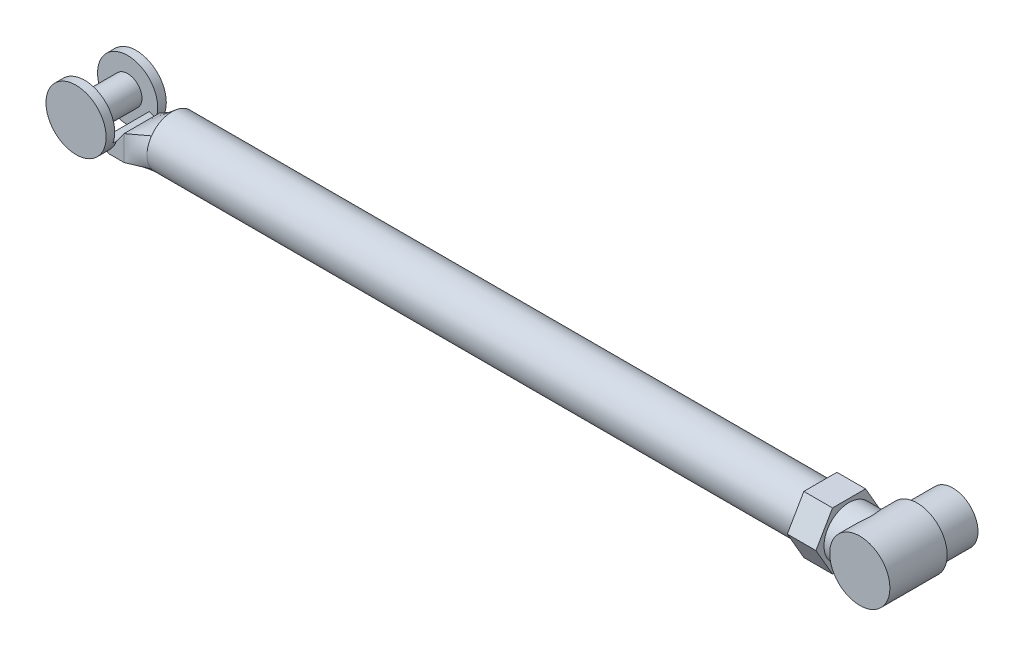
ISO-10303-21;
HEADER;
FILE_DESCRIPTION(('STEP AP214'),'2;1');
FILE_NAME('part.step','',(''),(''),'','','');
FILE_SCHEMA(('AUTOMOTIVE_DESIGN { 1 0 10303 214 1 1 1 1 }'));
ENDSEC;
DATA;
#1=APPLICATION_CONTEXT('core data for automotive mechanical design processes');
#2=APPLICATION_PROTOCOL_DEFINITION('international standard','automotive_design',2000,#1);
#3=PRODUCT_CONTEXT('',#1,'mechanical');
#4=PRODUCT('Part','Part','',(#3));
#5=PRODUCT_RELATED_PRODUCT_CATEGORY('part','',(#4));
#6=PRODUCT_DEFINITION_FORMATION('','',#4);
#7=PRODUCT_DEFINITION_CONTEXT('part definition',#1,'design');
#8=PRODUCT_DEFINITION('design','',#6,#7);
#9=PRODUCT_DEFINITION_SHAPE('','',#8);
#10=(LENGTH_UNIT() NAMED_UNIT(*) SI_UNIT(.MILLI.,.METRE.));
#11=(NAMED_UNIT(*) PLANE_ANGLE_UNIT() SI_UNIT($,.RADIAN.));
#12=(NAMED_UNIT(*) SI_UNIT($,.STERADIAN.) SOLID_ANGLE_UNIT());
#13=UNCERTAINTY_MEASURE_WITH_UNIT(LENGTH_MEASURE(1.E-05),#10,'distance_accuracy_value','');
#14=(GEOMETRIC_REPRESENTATION_CONTEXT(3) GLOBAL_UNCERTAINTY_ASSIGNED_CONTEXT((#13)) GLOBAL_UNIT_ASSIGNED_CONTEXT((#10,
#11,#12)) REPRESENTATION_CONTEXT('',''));
#15=CARTESIAN_POINT('',(0.,0.,0.));
#16=DIRECTION('',(0.,0.,1.));
#17=DIRECTION('',(1.,0.,0.));
#18=AXIS2_PLACEMENT_3D('',#15,#16,#17);
#19=CARTESIAN_POINT('',(-5000.,0.,200.));
#20=DIRECTION('',(1.,0.,0.));
#21=DIRECTION('',(0.,0.,-1.));
#22=AXIS2_PLACEMENT_3D('',#19,#20,#21);
#23=CYLINDRICAL_SURFACE('',#22,175.);
#24=CARTESIAN_POINT('',(-5000.,100.355910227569,56.6344138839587));
#25=CARTESIAN_POINT('',(-4999.99999230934,101.325629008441,57.3132181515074));
#26=CARTESIAN_POINT('',(-4999.99996846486,102.288423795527,58.0018338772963));
#27=CARTESIAN_POINT('',(-4999.999919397,104.199843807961,59.3984574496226));
#28=CARTESIAN_POINT('',(-4999.99989417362,105.148469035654,60.1064652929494));
#29=CARTESIAN_POINT('',(-4999.99986283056,107.972400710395,62.2590727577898));
#30=CARTESIAN_POINT('',(-4999.9999010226,109.825977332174,63.7324062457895));
#31=CARTESIAN_POINT('',(-4999.99997218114,112.560170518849,65.9977264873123));
#32=CARTESIAN_POINT('',(-4999.99999821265,113.463879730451,66.7620593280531));
#33=CARTESIAN_POINT('',(-4999.99999841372,115.25561329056,68.3089058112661));
#34=CARTESIAN_POINT('',(-4999.99997258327,116.143637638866,69.0914194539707));
#35=CARTESIAN_POINT('',(-4999.99987969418,118.783571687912,71.4657035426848));
#36=CARTESIAN_POINT('',(-4999.99979723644,120.511460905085,73.0843153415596));
#37=CARTESIAN_POINT('',(-4999.99981960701,123.899583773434,76.3897553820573));
#38=CARTESIAN_POINT('',(-4999.99992437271,125.559839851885,78.0765606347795));
#39=CARTESIAN_POINT('',(-4999.9999968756,127.99781716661,80.656131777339));
#40=CARTESIAN_POINT('',(-5000.00000693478,128.801761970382,81.5242391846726));
#41=CARTESIAN_POINT('',(-4999.99995646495,130.391882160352,83.2765796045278));
#42=CARTESIAN_POINT('',(-4999.99989593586,131.178057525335,84.1608126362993));
#43=CARTESIAN_POINT('',(-4999.9997531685,133.5094370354,86.8371581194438));
#44=CARTESIAN_POINT('',(-4999.99970974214,135.02756024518,88.6529864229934));
#45=CARTESIAN_POINT('',(-4999.99982012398,137.988930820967,92.3447405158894));
#46=CARTESIAN_POINT('',(-4999.9999739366,139.432176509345,94.2206676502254));
#47=CARTESIAN_POINT('',(-5000.00000169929,141.810243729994,97.444917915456));
#48=CARTESIAN_POINT('',(-4999.9999470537,142.765161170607,98.7784676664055));
#49=CARTESIAN_POINT('',(-4999.99980704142,144.637164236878,101.471930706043));
#50=CARTESIAN_POINT('',(-4999.99972167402,145.554248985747,102.831844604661));
#51=CARTESIAN_POINT('',(-4999.99965964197,147.349850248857,105.576953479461));
#52=CARTESIAN_POINT('',(-4999.99968298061,148.228365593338,106.962149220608));
#53=CARTESIAN_POINT('',(-4999.99980566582,149.946103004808,109.756683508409));
#54=CARTESIAN_POINT('',(-4999.99990501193,150.785325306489,111.166021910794));
#55=CARTESIAN_POINT('',(-4999.9999989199,152.423825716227,114.007747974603));
#56=CARTESIAN_POINT('',(-4999.99999348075,153.223103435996,115.440135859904));
#57=CARTESIAN_POINT('',(-4999.99986971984,154.781075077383,118.326816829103));
#58=CARTESIAN_POINT('',(-4999.99975139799,155.539768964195,119.781109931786));
#59=CARTESIAN_POINT('',(-4999.99962021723,157.015855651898,122.710218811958));
#60=CARTESIAN_POINT('',(-4999.99960734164,157.733254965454,124.185031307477));
#61=CARTESIAN_POINT('',(-4999.99968169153,159.126317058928,127.15424214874));
#62=CARTESIAN_POINT('',(-4999.99976891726,159.801979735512,128.648640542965));
#63=CARTESIAN_POINT('',(-4999.99993593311,161.111030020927,131.655832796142));
#64=CARTESIAN_POINT('',(-5000.00001572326,161.744417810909,133.168626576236));
#65=CARTESIAN_POINT('',(-4999.9999757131,162.968413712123,136.211401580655));
#66=CARTESIAN_POINT('',(-4999.99985591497,163.559022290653,137.741382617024));
#67=CARTESIAN_POINT('',(-4999.99966490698,164.696990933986,140.817315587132));
#68=CARTESIAN_POINT('',(-4999.9995936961,165.244351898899,142.363267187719));
#69=CARTESIAN_POINT('',(-4999.99957071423,166.295420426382,145.469984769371));
#70=CARTESIAN_POINT('',(-4999.99961894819,166.799126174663,147.030751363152));
#71=CARTESIAN_POINT('',(-4999.99982237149,168.003261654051,150.949482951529));
#72=CARTESIAN_POINT('',(-5000.00001897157,168.676171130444,153.315965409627));
#73=CARTESIAN_POINT('',(-4999.99997368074,169.921657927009,158.075286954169));
#74=CARTESIAN_POINT('',(-4999.9997317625,170.494228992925,160.468127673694));
#75=CARTESIAN_POINT('',(-4999.99951278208,171.53798257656,165.275786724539));
#76=CARTESIAN_POINT('',(-4999.9995357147,172.009167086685,167.690604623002));
#77=CARTESIAN_POINT('',(-4999.99978234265,172.849310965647,172.537912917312));
#78=CARTESIAN_POINT('',(-5000.00000603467,173.218272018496,174.970403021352));
#79=CARTESIAN_POINT('',(-4999.99999371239,173.853377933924,179.849183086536));
#80=CARTESIAN_POINT('',(-4999.99975762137,174.119505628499,182.295475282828));
#81=CARTESIAN_POINT('',(-4999.99951046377,174.548384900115,187.19711390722));
#82=CARTESIAN_POINT('',(-4999.99949939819,174.711136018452,189.652460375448));
#83=CARTESIAN_POINT('',(-4999.99973460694,174.932969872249,194.567830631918));
#84=CARTESIAN_POINT('',(-4999.99998088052,174.992052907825,197.0278544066));
#85=CARTESIAN_POINT('',(-5000.00001193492,175.006449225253,201.948180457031));
#86=CARTESIAN_POINT('',(-4999.9997967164,174.961762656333,204.408482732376));
#87=CARTESIAN_POINT('',(-4999.99954100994,174.768693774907,209.324974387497));
#88=CARTESIAN_POINT('',(-4999.99950051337,174.620316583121,211.781163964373));
#89=CARTESIAN_POINT('',(-4999.99963280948,174.320204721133,215.458964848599));
#90=CARTESIAN_POINT('',(-4999.99970908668,174.207238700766,216.683853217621));
#91=CARTESIAN_POINT('',(-4999.99987156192,173.955507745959,219.130975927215));
#92=CARTESIAN_POINT('',(-4999.99995775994,173.816742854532,220.35321027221));
#93=CARTESIAN_POINT('',(-5000.00003478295,173.361836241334,224.01509447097));
#94=CARTESIAN_POINT('',(-4999.99984406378,173.007072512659,226.450048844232));
#95=CARTESIAN_POINT('',(-4999.99958412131,172.195194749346,231.30282707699));
#96=CARTESIAN_POINT('',(-4999.99951489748,171.738081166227,233.720651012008));
#97=CARTESIAN_POINT('',(-4999.99961903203,170.976320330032,237.331099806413));
#98=CARTESIAN_POINT('',(-4999.99968840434,170.709719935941,238.531861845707));
#99=CARTESIAN_POINT('',(-4999.99984481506,170.151259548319,240.927515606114));
#100=CARTESIAN_POINT('',(-4999.99993185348,169.859399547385,242.122407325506));
#101=CARTESIAN_POINT('',(-5000.00000814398,169.25054529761,244.50579424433));
#102=CARTESIAN_POINT('',(-4999.9999973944,168.933550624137,245.694289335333));
#103=CARTESIAN_POINT('',(-4999.99990404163,168.274584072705,248.064304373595));
#104=CARTESIAN_POINT('',(-4999.99982143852,167.932612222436,249.245824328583));
#105=CARTESIAN_POINT('',(-4999.99961994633,166.869419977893,252.779225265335));
#106=CARTESIAN_POINT('',(-4999.99954736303,166.11089599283,255.120052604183));
#107=CARTESIAN_POINT('',(-4999.99963578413,164.8997112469,258.605448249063));
#108=CARTESIAN_POINT('',(-4999.99969814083,164.483748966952,259.762941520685));
#109=CARTESIAN_POINT('',(-4999.99984674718,163.627517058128,262.068897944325));
#110=CARTESIAN_POINT('',(-4999.99993299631,163.187247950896,263.21736128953));
#111=CARTESIAN_POINT('',(-5000.00001700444,162.131677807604,265.886336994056));
#112=CARTESIAN_POINT('',(-4999.99997564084,161.506986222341,267.403143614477));
#113=CARTESIAN_POINT('',(-4999.99983162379,160.215235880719,270.41852306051));
#114=CARTESIAN_POINT('',(-4999.99972897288,159.548178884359,271.917096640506));
#115=CARTESIAN_POINT('',(-4999.99961632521,158.172175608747,274.894947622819));
#116=CARTESIAN_POINT('',(-4999.99960633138,157.463228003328,276.37422441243));
#117=CARTESIAN_POINT('',(-4999.99969984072,156.004016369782,279.312276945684));
#118=CARTESIAN_POINT('',(-4999.99980334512,155.25375189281,280.771052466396));
#119=CARTESIAN_POINT('',(-4999.99995743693,153.712472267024,283.66699765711));
#120=CARTESIAN_POINT('',(-5000.000008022,152.921455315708,285.104166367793));
#121=CARTESIAN_POINT('',(-4999.99995705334,151.299328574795,287.955692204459));
#122=CARTESIAN_POINT('',(-4999.99985549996,150.468218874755,289.370049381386));
#123=CARTESIAN_POINT('',(-4999.99971180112,148.766777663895,292.174481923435));
#124=CARTESIAN_POINT('',(-4999.99966964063,147.896456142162,293.564563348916));
#125=CARTESIAN_POINT('',(-4999.99968956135,146.117085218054,296.31971060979));
#126=CARTESIAN_POINT('',(-4999.99975164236,145.208035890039,297.68477649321));
#127=CARTESIAN_POINT('',(-4999.99990343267,143.351977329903,300.388742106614));
#128=CARTESIAN_POINT('',(-4999.99999314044,142.404970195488,301.727643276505));
#129=CARTESIAN_POINT('',(-5000.00000674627,140.473688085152,304.378311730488));
#130=CARTESIAN_POINT('',(-4999.9999306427,139.489412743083,305.690078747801));
#131=CARTESIAN_POINT('',(-4999.99980169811,137.484568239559,308.285185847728));
#132=CARTESIAN_POINT('',(-4999.99974885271,136.464005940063,309.568531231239));
#133=CARTESIAN_POINT('',(-4999.99973319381,134.387261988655,312.105983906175));
#134=CARTESIAN_POINT('',(-4999.99977037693,133.331081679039,313.360092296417));
#135=CARTESIAN_POINT('',(-4999.99989615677,131.081547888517,315.956251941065));
#136=CARTESIAN_POINT('',(-4999.99998931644,129.884715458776,317.295291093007));
#137=CARTESIAN_POINT('',(-5000.0000106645,127.450575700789,319.935710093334));
#138=CARTESIAN_POINT('',(-4999.99993887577,126.21327400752,321.237095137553));
#139=CARTESIAN_POINT('',(-4999.99982962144,123.699320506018,323.801055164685));
#140=CARTESIAN_POINT('',(-4999.99979215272,122.422672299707,325.063633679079));
#141=CARTESIAN_POINT('',(-4999.99982273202,119.831186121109,327.548852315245));
#142=CARTESIAN_POINT('',(-4999.99989077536,118.51634984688,328.771494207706));
#143=CARTESIAN_POINT('',(-4999.99997866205,115.851296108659,331.174281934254));
#144=CARTESIAN_POINT('',(-4999.99999856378,114.501123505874,332.354477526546));
#145=CARTESIAN_POINT('',(-4999.999965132,111.765082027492,334.672869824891));
#146=CARTESIAN_POINT('',(-4999.99991179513,110.37921151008,335.811064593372));
#147=CARTESIAN_POINT('',(-4999.99987014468,107.573008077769,338.044426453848));
#148=CARTESIAN_POINT('',(-4999.99988183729,106.152671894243,339.13958943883));
#149=CARTESIAN_POINT('',(-4999.99993120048,103.278804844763,341.285902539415));
#150=CARTESIAN_POINT('',(-4999.99996887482,101.825269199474,342.337046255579));
#151=CARTESIAN_POINT('',(-5000.,100.355910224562,343.365586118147));
#152=B_SPLINE_CURVE_WITH_KNOTS('',3,(#24,#25,#26,#27,#28,#29,#30,#31,#32,#33,#34,#35,#36,#37,
#38,#39,#40,#41,#42,#43,#44,#45,#46,#47,#48,#49,#50,#51,#52,#53,#54,#55,#56,#57,#58,#59,#60,#61,
#62,#63,#64,#65,#66,#67,#68,#69,#70,#71,#72,#73,#74,#75,#76,#77,#78,#79,#80,#81,#82,#83,#84,#85,
#86,#87,#88,#89,#90,#91,#92,#93,#94,#95,#96,#97,#98,#99,#100,#101,#102,#103,#104,#105,#106,#107,
#108,#109,#110,#111,#112,#113,#114,#115,#116,#117,#118,#119,#120,#121,#122,#123,#124,#125,#126,
#127,#128,#129,#130,#131,#132,#133,#134,#135,#136,#137,#138,#139,#140,#141,#142,#143,#144,#145,
#146,#147,#148,#149,#150,#151),.UNSPECIFIED.,.F.,.F.,(4,2,2,2,2,2,2,2,2,2,2,2,2,2,2,2,2,2,2,2,2,
2,2,2,2,2,2,2,2,2,2,2,2,2,2,2,2,2,2,2,2,2,2,2,2,2,2,2,2,2,2,2,2,2,2,2,2,2,2,2,2,2,2,4),(0.,
3.55092718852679,7.10185378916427,14.202923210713,17.7535125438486,21.3041019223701,
28.4048193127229,35.5031625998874,39.0525183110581,42.6018782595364,49.7003116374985,
56.7989039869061,61.7188705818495,66.6389511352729,71.5591808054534,76.4793810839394,
81.3996291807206,86.3198814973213,91.2393556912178,96.1588420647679,101.078307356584,
105.997718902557,110.917028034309,115.836541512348,123.215103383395,130.594125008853,
137.973001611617,145.351756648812,152.731743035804,160.111762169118,167.491759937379,
174.871747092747,182.251369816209,185.941394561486,189.631413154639,197.011079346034,
204.390712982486,208.080490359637,211.770268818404,215.460109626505,219.149946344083,
226.529294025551,230.218982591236,233.908592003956,238.829148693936,243.749501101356,
248.670009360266,253.590571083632,258.511350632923,263.432119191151,268.351641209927,
273.271153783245,278.190394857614,283.10968427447,288.028048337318,292.946227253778,
298.333210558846,303.719446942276,309.105191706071,314.490697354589,319.86966909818,
325.248888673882,330.628620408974,336.009131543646),.UNSPECIFIED.);
#153=CARTESIAN_POINT('',(-5000.,100.355997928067,56.6342885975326));
#154=VERTEX_POINT('',#153);
#155=CARTESIAN_POINT('',(-5000.,100.356003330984,343.365719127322));
#156=VERTEX_POINT('',#155);
#157=EDGE_CURVE('E383',#154,#156,#152,.T.);
#158=ORIENTED_EDGE('',*,*,#157,.T.);
#159=CARTESIAN_POINT('',(-5000.,0.,200.));
#160=DIRECTION('',(1.,0.,0.));
#161=DIRECTION('',(0.,0.,-1.));
#162=AXIS2_PLACEMENT_3D('',#159,#160,#161);
#163=CIRCLE('',#162,175.);
#164=CARTESIAN_POINT('',(-5000.,-100.355996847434,343.365709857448));
#165=VERTEX_POINT('',#164);
#166=EDGE_CURVE('E375',#156,#165,#163,.T.);
#167=ORIENTED_EDGE('',*,*,#166,.T.);
#168=CARTESIAN_POINT('',(-5000.,-100.35600225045,56.6342824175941));
#169=VERTEX_POINT('',#168);
#170=EDGE_CURVE('E365',#165,#169,#163,.T.);
#171=ORIENTED_EDGE('',*,*,#170,.T.);
#172=EDGE_CURVE('E378',#169,#154,#163,.T.);
#173=ORIENTED_EDGE('',*,*,#172,.T.);
#174=EDGE_LOOP('',(#158,#167,#171,#173));
#175=FACE_BOUND('',#174,.T.);
#176=CARTESIAN_POINT('',(-475.,0.,200.));
#177=DIRECTION('',(1.,0.,0.));
#178=DIRECTION('',(0.,0.,-1.));
#179=AXIS2_PLACEMENT_3D('',#176,#177,#178);
#180=CIRCLE('',#179,175.);
#181=CARTESIAN_POINT('',(-475.,0.,25.));
#182=VERTEX_POINT('',#181);
#183=EDGE_CURVE('E81',#182,#182,#180,.F.);
#184=ORIENTED_EDGE('',*,*,#183,.T.);
#185=EDGE_LOOP('',(#184));
#186=FACE_BOUND('',#185,.T.);
#187=ADVANCED_FACE('F77',(#175,#186),#23,.T.);
#188=CARTESIAN_POINT('',(-5460.,0.,410.));
#189=DIRECTION('',(0.,0.,-1.));
#190=DIRECTION('',(-1.,0.,0.));
#191=AXIS2_PLACEMENT_3D('',#188,#189,#190);
#192=CYLINDRICAL_SURFACE('',#191,210.000000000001);
#193=CARTESIAN_POINT('',(-5460.,0.,-9.99999999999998));
#194=DIRECTION('',(0.,0.,1.));
#195=DIRECTION('',(1.,0.,0.));
#196=AXIS2_PLACEMENT_3D('',#193,#194,#195);
#197=CIRCLE('',#196,210.000000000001);
#198=CARTESIAN_POINT('',(-5250.,0.,-9.99999999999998));
#199=VERTEX_POINT('',#198);
#200=EDGE_CURVE('E324',#199,#199,#197,.T.);
#201=ORIENTED_EDGE('',*,*,#200,.T.);
#202=EDGE_LOOP('',(#201));
#203=FACE_BOUND('',#202,.T.);
#204=CARTESIAN_POINT('',(-5460.,0.,50.));
#205=DIRECTION('',(0.,0.,1.));
#206=DIRECTION('',(1.,0.,0.));
#207=AXIS2_PLACEMENT_3D('',#204,#205,#206);
#208=CIRCLE('',#207,210.000000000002);
#209=CARTESIAN_POINT('',(-5262.66454963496,-71.8242300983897,50.));
#210=VERTEX_POINT('',#209);
#211=CARTESIAN_POINT('',(-5325.01460196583,-160.869333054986,50.));
#212=VERTEX_POINT('',#211);
#213=EDGE_CURVE('E288',#210,#212,#208,.T.);
#214=ORIENTED_EDGE('',*,*,#213,.F.);
#215=DIRECTION('',(0.,0.,1.));
#216=VECTOR('',#215,1.);
#217=CARTESIAN_POINT('',(-5262.66454963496,-71.8242300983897,50.));
#218=LINE('',#217,#216);
#219=CARTESIAN_POINT('',(-5262.66454963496,-71.8242300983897,75.));
#220=VERTEX_POINT('',#219);
#221=EDGE_CURVE('E320',#210,#220,#218,.T.);
#222=ORIENTED_EDGE('',*,*,#221,.T.);
#223=CARTESIAN_POINT('',(-5460.,0.,75.));
#224=DIRECTION('',(0.,0.,-1.));
#225=DIRECTION('',(1.,0.,0.));
#226=AXIS2_PLACEMENT_3D('',#223,#224,#225);
#227=CIRCLE('',#226,210.000000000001);
#228=CARTESIAN_POINT('',(-5325.01460196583,-160.869333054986,75.));
#229=VERTEX_POINT('',#228);
#230=EDGE_CURVE('E337',#220,#229,#227,.T.);
#231=ORIENTED_EDGE('',*,*,#230,.T.);
#232=DIRECTION('',(0.,0.,1.));
#233=VECTOR('',#232,1.);
#234=CARTESIAN_POINT('',(-5325.01460196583,-160.869333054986,50.));
#235=LINE('',#234,#233);
#236=EDGE_CURVE('E305',#212,#229,#235,.T.);
#237=ORIENTED_EDGE('',*,*,#236,.F.);
#238=EDGE_LOOP('',(#214,#222,#231,#237));
#239=FACE_BOUND('',#238,.T.);
#240=ADVANCED_FACE('F410',(#203,#239),#192,.T.);
#241=CARTESIAN_POINT('',(-4997.9,101.359469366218,343.54924195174));
#242=CARTESIAN_POINT('',(-5000.,100.355910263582,343.365586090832));
#243=CARTESIAN_POINT('',(-5210.,0.,325.));
#244=CARTESIAN_POINT('',(-4997.9,106.302142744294,340.141453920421));
#245=CARTESIAN_POINT('',(-5000.,105.24964628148,339.939970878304));
#246=CARTESIAN_POINT('',(-5210.,0.,319.791666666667));
#247=CARTESIAN_POINT('',(-4997.9,111.200238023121,336.387440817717));
#248=CARTESIAN_POINT('',(-5000.,110.099245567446,336.171558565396));
#249=CARTESIAN_POINT('',(-5210.,0.,314.583333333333));
#250=CARTESIAN_POINT('',(-4997.9,120.784064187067,328.156260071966));
#251=CARTESIAN_POINT('',(-5000.,119.588182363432,327.918739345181));
#252=CARTESIAN_POINT('',(-5210.,0.,304.166666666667));
#253=CARTESIAN_POINT('',(-4997.9,125.469624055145,323.67883253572));
#254=CARTESIAN_POINT('',(-5000.,124.227350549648,323.434075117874));
#255=CARTESIAN_POINT('',(-5210.,0.,298.958333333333));
#256=CARTESIAN_POINT('',(-4997.9,134.488051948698,313.996280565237));
#257=CARTESIAN_POINT('',(-5000.,133.156487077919,313.744254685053));
#258=CARTESIAN_POINT('',(-5210.,0.,288.541666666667));
#259=CARTESIAN_POINT('',(-4997.9,138.820637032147,308.790937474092));
#260=CARTESIAN_POINT('',(-5000.,137.446175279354,308.53888198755));
#261=CARTESIAN_POINT('',(-5210.,0.,283.333333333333));
#262=CARTESIAN_POINT('',(-4997.9,146.982591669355,297.682050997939));
#263=CARTESIAN_POINT('',(-5000.,145.52731848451,297.436849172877));
#264=CARTESIAN_POINT('',(-5210.,0.,272.916666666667));
#265=CARTESIAN_POINT('',(-4997.9,150.811576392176,291.778383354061));
#266=CARTESIAN_POINT('',(-5000.,149.318392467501,291.540066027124));
#267=CARTESIAN_POINT('',(-5210.,0.,267.708333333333));
#268=CARTESIAN_POINT('',(-4997.9,157.815692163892,279.341739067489));
#269=CARTESIAN_POINT('',(-5000.,156.253160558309,279.123421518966));
#270=CARTESIAN_POINT('',(-5210.,0.,257.291666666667));
#271=CARTESIAN_POINT('',(-4997.9,160.99037475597,272.808783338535));
#272=CARTESIAN_POINT('',(-5000.,159.396410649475,272.603580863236));
#273=CARTESIAN_POINT('',(-5210.,0.,252.083333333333));
#274=CARTESIAN_POINT('',(-4997.9,166.547811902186,259.223586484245));
#275=CARTESIAN_POINT('',(-5000.,164.898823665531,259.049755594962));
#276=CARTESIAN_POINT('',(-5210.,0.,241.666666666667));
#277=CARTESIAN_POINT('',(-4997.9,168.930120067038,252.171543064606));
#278=CARTESIAN_POINT('',(-5000.,167.25754462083,252.015966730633));
#279=CARTESIAN_POINT('',(-5210.,0.,236.458333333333));
#280=CARTESIAN_POINT('',(-4997.9,172.790999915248,237.696142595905));
#281=CARTESIAN_POINT('',(-5000.,171.080197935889,237.580751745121));
#282=CARTESIAN_POINT('',(-5210.,0.,226.041666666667));
#283=CARTESIAN_POINT('',(-4997.9,174.269208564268,230.273156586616));
#284=CARTESIAN_POINT('',(-5000.,172.543770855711,230.179692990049));
#285=CARTESIAN_POINT('',(-5210.,0.,220.833333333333));
#286=CARTESIAN_POINT('',(-4997.9,176.248810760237,215.23320556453));
#287=CARTESIAN_POINT('',(-5000.,174.503773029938,215.185517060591));
#288=CARTESIAN_POINT('',(-5210.,0.,210.416666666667));
#289=CARTESIAN_POINT('',(-4997.9,176.75,207.616739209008));
#290=CARTESIAN_POINT('',(-5000.,175.,207.592893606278));
#291=CARTESIAN_POINT('',(-5210.,0.,205.208333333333));
#292=CARTESIAN_POINT('',(-4997.9,176.75,192.383260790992));
#293=CARTESIAN_POINT('',(-5000.,175.,192.407106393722));
#294=CARTESIAN_POINT('',(-5210.,0.,194.791666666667));
#295=CARTESIAN_POINT('',(-4997.9,176.248810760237,184.76679443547));
#296=CARTESIAN_POINT('',(-5000.,174.503773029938,184.814482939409));
#297=CARTESIAN_POINT('',(-5210.,0.,189.583333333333));
#298=CARTESIAN_POINT('',(-4997.9,174.269208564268,169.726843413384));
#299=CARTESIAN_POINT('',(-5000.,172.543770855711,169.820307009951));
#300=CARTESIAN_POINT('',(-5210.,0.,179.166666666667));
#301=CARTESIAN_POINT('',(-4997.9,172.790999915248,162.303857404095));
#302=CARTESIAN_POINT('',(-5000.,171.080197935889,162.41924825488));
#303=CARTESIAN_POINT('',(-5210.,0.,173.958333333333));
#304=CARTESIAN_POINT('',(-4997.9,168.930120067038,147.828456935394));
#305=CARTESIAN_POINT('',(-5000.,167.25754462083,147.984033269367));
#306=CARTESIAN_POINT('',(-5210.,0.,163.541666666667));
#307=CARTESIAN_POINT('',(-4997.9,166.547811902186,140.776413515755));
#308=CARTESIAN_POINT('',(-5000.,164.898823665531,140.950244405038));
#309=CARTESIAN_POINT('',(-5210.,0.,158.333333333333));
#310=CARTESIAN_POINT('',(-4997.9,160.99037475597,127.191216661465));
#311=CARTESIAN_POINT('',(-5000.,159.396410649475,127.396419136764));
#312=CARTESIAN_POINT('',(-5210.,0.,147.916666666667));
#313=CARTESIAN_POINT('',(-4997.9,157.815692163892,120.658260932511));
#314=CARTESIAN_POINT('',(-5000.,156.253160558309,120.876578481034));
#315=CARTESIAN_POINT('',(-5210.,0.,142.708333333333));
#316=CARTESIAN_POINT('',(-4997.9,150.811576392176,108.221616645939));
#317=CARTESIAN_POINT('',(-5000.,149.318392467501,108.459933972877));
#318=CARTESIAN_POINT('',(-5210.,0.,132.291666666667));
#319=CARTESIAN_POINT('',(-4997.9,146.982591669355,102.317949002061));
#320=CARTESIAN_POINT('',(-5000.,145.52731848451,102.563150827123));
#321=CARTESIAN_POINT('',(-5210.,0.,127.083333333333));
#322=CARTESIAN_POINT('',(-4997.9,138.820637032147,91.209062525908));
#323=CARTESIAN_POINT('',(-5000.,137.446175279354,91.4611180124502));
#324=CARTESIAN_POINT('',(-5210.,0.,116.666666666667));
#325=CARTESIAN_POINT('',(-4997.9,134.488051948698,86.0037194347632));
#326=CARTESIAN_POINT('',(-5000.,133.156487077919,86.255745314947));
#327=CARTESIAN_POINT('',(-5210.,0.,111.458333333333));
#328=CARTESIAN_POINT('',(-4997.9,125.469624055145,76.3211674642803));
#329=CARTESIAN_POINT('',(-5000.,124.227350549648,76.5659248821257));
#330=CARTESIAN_POINT('',(-5210.,0.,101.041666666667));
#331=CARTESIAN_POINT('',(-4997.9,120.784064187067,71.8437399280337));
#332=CARTESIAN_POINT('',(-5000.,119.588182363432,72.0812606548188));
#333=CARTESIAN_POINT('',(-5210.,0.,95.8333333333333));
#334=CARTESIAN_POINT('',(-4997.9,111.200238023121,63.6125591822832));
#335=CARTESIAN_POINT('',(-5000.,110.099245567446,63.8284414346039));
#336=CARTESIAN_POINT('',(-5210.,0.,85.4166666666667));
#337=CARTESIAN_POINT('',(-4997.9,106.302142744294,59.8585460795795));
#338=CARTESIAN_POINT('',(-5000.,105.24964628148,60.0600291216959));
#339=CARTESIAN_POINT('',(-5210.,0.,80.2083333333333));
#340=CARTESIAN_POINT('',(-4997.9,101.359469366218,56.4507580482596));
#341=CARTESIAN_POINT('',(-5000.,100.355910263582,56.6344139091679));
#342=CARTESIAN_POINT('',(-5210.,0.,75.));
#343=B_SPLINE_SURFACE_WITH_KNOTS('',3,1,((#241,#242,#243),(#244,#245,#246),(#247,#248,#249),
(#250,#251,#252),(#253,#254,#255),(#256,#257,#258),(#259,#260,#261),(#262,#263,#264),(#265,#266,
#267),(#268,#269,#270),(#271,#272,#273),(#274,#275,#276),(#277,#278,#279),(#280,#281,#282),
(#283,#284,#285),(#286,#287,#288),(#289,#290,#291),(#292,#293,#294),(#295,#296,#297),(#298,#299,
#300),(#301,#302,#303),(#304,#305,#306),(#307,#308,#309),(#310,#311,#312),(#313,#314,#315),
(#316,#317,#318),(#319,#320,#321),(#322,#323,#324),(#325,#326,#327),(#328,#329,#330),(#331,#332,
#333),(#334,#335,#336),(#337,#338,#339),(#340,#341,#342)),.UNSPECIFIED.,.F.,.F.,.F.,(4,2,2,2,2,
2,2,2,2,2,2,2,2,2,2,2,4),(2,1,2),(0.,0.0625,0.125,0.1875,0.25,0.3125,0.375,0.4375,0.5,0.5625,
0.625,0.6875,0.75,0.8125,0.875,0.9375,1.),(-0.01,0.,1.),.UNSPECIFIED.);
#344=DIRECTION('',(-0.899470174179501,-0.429843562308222,0.0786633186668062));
#345=VECTOR('',#344,1.);
#346=CARTESIAN_POINT('',(-5105.,50.1779551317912,65.817206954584));
#347=LINE('',#346,#345);
#348=CARTESIAN_POINT('',(-5210.,0.,75.));
#349=VERTEX_POINT('',#348);
#350=EDGE_CURVE('E518',#154,#349,#347,.T.);
#351=DIRECTION('',(0.,0.,-1.));
#352=VECTOR('',#351,1.);
#353=CARTESIAN_POINT('',(-5210.,0.,325.));
#354=LINE('',#353,#352);
#355=CARTESIAN_POINT('',(-5210.,0.,325.));
#356=VERTEX_POINT('',#355);
#357=EDGE_CURVE('E680',#356,#349,#354,.T.);
#358=DIRECTION('',(0.899470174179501,0.429843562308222,0.0786633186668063));
#359=VECTOR('',#358,1.);
#360=CARTESIAN_POINT('',(-5105.,50.1779551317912,334.182793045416));
#361=LINE('',#360,#359);
#362=EDGE_CURVE('E382',#356,#156,#361,.T.);
#363=ORIENTED_EDGE('',*,*,#157,.F.);
#364=ORIENTED_EDGE('',*,*,#350,.T.);
#365=ORIENTED_EDGE('',*,*,#357,.F.);
#366=ORIENTED_EDGE('',*,*,#362,.T.);
#367=EDGE_LOOP('',(#363,#364,#365,#366));
#368=FACE_BOUND('',#367,.T.);
#369=ADVANCED_FACE('F402',(#368),#343,.T.);
#370=CARTESIAN_POINT('',(-5000.,100.355910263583,56.634413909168));
#371=CARTESIAN_POINT('',(-5210.,0.,75.));
#372=CARTESIAN_POINT('',(-5000.,93.5046798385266,51.8385526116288));
#373=CARTESIAN_POINT('',(-5210.,-7.29166666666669,75.));
#374=CARTESIAN_POINT('',(-5000.,86.1512280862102,47.4261389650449));
#375=CARTESIAN_POINT('',(-5210.,-14.5833333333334,75.));
#376=CARTESIAN_POINT('',(-5000.,70.5802738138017,39.6278012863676));
#377=CARTESIAN_POINT('',(-5210.,-29.1666666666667,75.));
#378=CARTESIAN_POINT('',(-5000.,62.3629883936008,36.2430495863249));
#379=CARTESIAN_POINT('',(-5210.,-36.4583333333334,75.));
#380=CARTESIAN_POINT('',(-5000.,45.2905426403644,30.724343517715));
#381=CARTESIAN_POINT('',(-5210.,-51.0416666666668,75.));
#382=CARTESIAN_POINT('',(-5000.,36.4361566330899,28.5914366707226));
#383=CARTESIAN_POINT('',(-5210.,-58.3333333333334,75.));
#384=CARTESIAN_POINT('',(-5000.,18.3872630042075,25.7289534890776));
#385=CARTESIAN_POINT('',(-5210.,-72.9166666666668,75.));
#386=CARTESIAN_POINT('',(-5000.,9.19398173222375,25.));
#387=CARTESIAN_POINT('',(-5210.,-80.2083333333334,75.));
#388=CARTESIAN_POINT('',(-5000.,-9.19398173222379,25.));
#389=CARTESIAN_POINT('',(-5210.,-94.7916666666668,75.));
#390=CARTESIAN_POINT('',(-5000.,-18.3872630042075,25.7289534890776));
#391=CARTESIAN_POINT('',(-5210.,-102.083333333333,75.));
#392=CARTESIAN_POINT('',(-5000.,-36.4361566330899,28.5914366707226));
#393=CARTESIAN_POINT('',(-5210.,-116.666666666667,75.));
#394=CARTESIAN_POINT('',(-5000.,-45.2905426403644,30.724343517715));
#395=CARTESIAN_POINT('',(-5210.,-123.958333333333,75.));
#396=CARTESIAN_POINT('',(-5000.,-62.3629883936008,36.243049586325));
#397=CARTESIAN_POINT('',(-5210.,-138.541666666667,75.));
#398=CARTESIAN_POINT('',(-5000.,-70.5802738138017,39.6278012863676));
#399=CARTESIAN_POINT('',(-5210.,-145.833333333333,75.));
#400=CARTESIAN_POINT('',(-5000.,-86.1512280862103,47.4261389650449));
#401=CARTESIAN_POINT('',(-5210.,-160.416666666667,75.));
#402=CARTESIAN_POINT('',(-5000.,-93.5046798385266,51.8385526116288));
#403=CARTESIAN_POINT('',(-5210.,-167.708333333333,75.));
#404=CARTESIAN_POINT('',(-5000.,-100.355910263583,56.634413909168));
#405=CARTESIAN_POINT('',(-5210.,-175.,75.));
#406=B_SPLINE_SURFACE_WITH_KNOTS('',3,1,((#370,#371),(#372,#373),(#374,#375),(#376,#377),(#378,
#379),(#380,#381),(#382,#383),(#384,#385),(#386,#387),(#388,#389),(#390,#391),(#392,#393),(#394,
#395),(#396,#397),(#398,#399),(#400,#401),(#402,#403),(#404,#405)),.UNSPECIFIED.,.F.,.F.,.F.,(4,
2,2,2,2,2,2,2,4),(2,2),(0.,0.125,0.25,0.375,0.5,0.625,0.75,0.875,1.),(0.,1.),.UNSPECIFIED.);
#407=DIRECTION('',(-0.939063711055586,-0.333788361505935,0.0821259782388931));
#408=VECTOR('',#407,1.);
#409=CARTESIAN_POINT('',(-5105.,-137.677955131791,65.817206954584));
#410=LINE('',#409,#408);
#411=CARTESIAN_POINT('',(-5210.,-175.,75.));
#412=VERTEX_POINT('',#411);
#413=EDGE_CURVE('E521',#169,#412,#410,.T.);
#414=DIRECTION('',(0.,1.,0.));
#415=VECTOR('',#414,1.);
#416=CARTESIAN_POINT('',(-5210.,0.,75.));
#417=LINE('',#416,#415);
#418=EDGE_CURVE('E441',#412,#349,#417,.T.);
#419=ORIENTED_EDGE('',*,*,#172,.F.);
#420=ORIENTED_EDGE('',*,*,#413,.T.);
#421=ORIENTED_EDGE('',*,*,#418,.T.);
#422=ORIENTED_EDGE('',*,*,#350,.F.);
#423=EDGE_LOOP('',(#419,#420,#421,#422));
#424=FACE_BOUND('',#423,.T.);
#425=ADVANCED_FACE('F409',(#424),#406,.T.);
#426=CARTESIAN_POINT('',(-5000.,-100.355910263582,343.365586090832));
#427=CARTESIAN_POINT('',(-5210.,-175.,325.));
#428=CARTESIAN_POINT('',(-5000.,-93.5046798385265,348.161447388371));
#429=CARTESIAN_POINT('',(-5210.,-167.708333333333,325.));
#430=CARTESIAN_POINT('',(-5000.,-86.1512280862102,352.573861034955));
#431=CARTESIAN_POINT('',(-5210.,-160.416666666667,325.));
#432=CARTESIAN_POINT('',(-5000.,-70.5802738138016,360.372198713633));
#433=CARTESIAN_POINT('',(-5210.,-145.833333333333,325.));
#434=CARTESIAN_POINT('',(-5000.,-62.3629883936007,363.756950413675));
#435=CARTESIAN_POINT('',(-5210.,-138.541666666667,325.));
#436=CARTESIAN_POINT('',(-5000.,-45.2905426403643,369.275656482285));
#437=CARTESIAN_POINT('',(-5210.,-123.958333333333,325.));
#438=CARTESIAN_POINT('',(-5000.,-36.4361566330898,371.408563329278));
#439=CARTESIAN_POINT('',(-5210.,-116.666666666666,325.));
#440=CARTESIAN_POINT('',(-5000.,-18.3872630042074,374.271046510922));
#441=CARTESIAN_POINT('',(-5210.,-102.083333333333,325.));
#442=CARTESIAN_POINT('',(-5000.,-9.19398173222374,375.));
#443=CARTESIAN_POINT('',(-5210.,-94.7916666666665,325.));
#444=CARTESIAN_POINT('',(-5000.,9.19398173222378,375.));
#445=CARTESIAN_POINT('',(-5210.,-80.2083333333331,325.));
#446=CARTESIAN_POINT('',(-5000.,18.3872630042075,374.271046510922));
#447=CARTESIAN_POINT('',(-5210.,-72.9166666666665,325.));
#448=CARTESIAN_POINT('',(-5000.,36.4361566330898,371.408563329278));
#449=CARTESIAN_POINT('',(-5210.,-58.3333333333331,325.));
#450=CARTESIAN_POINT('',(-5000.,45.2905426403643,369.275656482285));
#451=CARTESIAN_POINT('',(-5210.,-51.0416666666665,325.));
#452=CARTESIAN_POINT('',(-5000.,62.3629883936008,363.756950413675));
#453=CARTESIAN_POINT('',(-5210.,-36.4583333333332,325.));
#454=CARTESIAN_POINT('',(-5000.,70.5802738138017,360.372198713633));
#455=CARTESIAN_POINT('',(-5210.,-29.1666666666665,325.));
#456=CARTESIAN_POINT('',(-5000.,86.1512280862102,352.573861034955));
#457=CARTESIAN_POINT('',(-5210.,-14.5833333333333,325.));
#458=CARTESIAN_POINT('',(-5000.,93.5046798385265,348.161447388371));
#459=CARTESIAN_POINT('',(-5210.,-7.29166666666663,325.));
#460=CARTESIAN_POINT('',(-5000.,100.355910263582,343.365586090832));
#461=CARTESIAN_POINT('',(-5210.,0.,325.));
#462=B_SPLINE_SURFACE_WITH_KNOTS('',3,1,((#426,#427),(#428,#429),(#430,#431),(#432,#433),(#434,
#435),(#436,#437),(#438,#439),(#440,#441),(#442,#443),(#444,#445),(#446,#447),(#448,#449),(#450,
#451),(#452,#453),(#454,#455),(#456,#457),(#458,#459),(#460,#461)),.UNSPECIFIED.,.F.,.F.,.F.,(4,
2,2,2,2,2,2,2,4),(2,2),(0.,0.125,0.25,0.375,0.5,0.625,0.75,0.875,1.),(0.,1.),.UNSPECIFIED.);
#463=DIRECTION('',(0.,1.,0.));
#464=VECTOR('',#463,1.);
#465=CARTESIAN_POINT('',(-5210.,0.,325.));
#466=LINE('',#465,#464);
#467=CARTESIAN_POINT('',(-5210.,-175.,325.));
#468=VERTEX_POINT('',#467);
#469=EDGE_CURVE('E502',#468,#356,#466,.T.);
#470=DIRECTION('',(-0.939063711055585,-0.333788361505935,-0.0821259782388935));
#471=VECTOR('',#470,1.);
#472=CARTESIAN_POINT('',(-5105.,-137.677955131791,334.182793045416));
#473=LINE('',#472,#471);
#474=EDGE_CURVE('E528',#165,#468,#473,.T.);
#475=ORIENTED_EDGE('',*,*,#166,.F.);
#476=ORIENTED_EDGE('',*,*,#362,.F.);
#477=ORIENTED_EDGE('',*,*,#469,.F.);
#478=ORIENTED_EDGE('',*,*,#474,.F.);
#479=EDGE_LOOP('',(#475,#476,#477,#478));
#480=FACE_BOUND('',#479,.T.);
#481=ADVANCED_FACE('F471',(#480),#462,.T.);
#482=CARTESIAN_POINT('',(-5000.,-100.355910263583,56.634413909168));
#483=CARTESIAN_POINT('',(-5210.,-175.,75.));
#484=CARTESIAN_POINT('',(-5000.,-105.24964628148,60.0600291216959));
#485=CARTESIAN_POINT('',(-5210.,-175.,80.2083333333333));
#486=CARTESIAN_POINT('',(-5000.,-110.099245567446,63.8284414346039));
#487=CARTESIAN_POINT('',(-5210.,-175.,85.4166666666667));
#488=CARTESIAN_POINT('',(-5000.,-119.588182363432,72.0812606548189));
#489=CARTESIAN_POINT('',(-5210.,-175.,95.8333333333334));
#490=CARTESIAN_POINT('',(-5000.,-124.227350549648,76.5659248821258));
#491=CARTESIAN_POINT('',(-5210.,-175.,101.041666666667));
#492=CARTESIAN_POINT('',(-5000.,-133.156487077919,86.2557453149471));
#493=CARTESIAN_POINT('',(-5210.,-175.,111.458333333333));
#494=CARTESIAN_POINT('',(-5000.,-137.446175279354,91.4611180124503));
#495=CARTESIAN_POINT('',(-5210.,-175.,116.666666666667));
#496=CARTESIAN_POINT('',(-5000.,-145.52731848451,102.563150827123));
#497=CARTESIAN_POINT('',(-5210.,-175.,127.083333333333));
#498=CARTESIAN_POINT('',(-5000.,-149.318392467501,108.459933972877));
#499=CARTESIAN_POINT('',(-5210.,-175.,132.291666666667));
#500=CARTESIAN_POINT('',(-5000.,-156.253160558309,120.876578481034));
#501=CARTESIAN_POINT('',(-5210.,-175.,142.708333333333));
#502=CARTESIAN_POINT('',(-5000.,-159.396410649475,127.396419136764));
#503=CARTESIAN_POINT('',(-5210.,-175.,147.916666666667));
#504=CARTESIAN_POINT('',(-5000.,-164.898823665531,140.950244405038));
#505=CARTESIAN_POINT('',(-5210.,-175.,158.333333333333));
#506=CARTESIAN_POINT('',(-5000.,-167.25754462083,147.984033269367));
#507=CARTESIAN_POINT('',(-5210.,-175.,163.541666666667));
#508=CARTESIAN_POINT('',(-5000.,-171.080197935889,162.41924825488));
#509=CARTESIAN_POINT('',(-5210.,-175.,173.958333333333));
#510=CARTESIAN_POINT('',(-5000.,-172.543770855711,169.820307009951));
#511=CARTESIAN_POINT('',(-5210.,-175.,179.166666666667));
#512=CARTESIAN_POINT('',(-5000.,-174.503773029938,184.814482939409));
#513=CARTESIAN_POINT('',(-5210.,-175.,189.583333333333));
#514=CARTESIAN_POINT('',(-5000.,-175.,192.407106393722));
#515=CARTESIAN_POINT('',(-5210.,-175.,194.791666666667));
#516=CARTESIAN_POINT('',(-5000.,-175.,207.592893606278));
#517=CARTESIAN_POINT('',(-5210.,-175.,205.208333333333));
#518=CARTESIAN_POINT('',(-5000.,-174.503773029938,215.185517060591));
#519=CARTESIAN_POINT('',(-5210.,-175.,210.416666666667));
#520=CARTESIAN_POINT('',(-5000.,-172.543770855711,230.179692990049));
#521=CARTESIAN_POINT('',(-5210.,-175.,220.833333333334));
#522=CARTESIAN_POINT('',(-5000.,-171.080197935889,237.580751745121));
#523=CARTESIAN_POINT('',(-5210.,-175.,226.041666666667));
#524=CARTESIAN_POINT('',(-5000.,-167.25754462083,252.015966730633));
#525=CARTESIAN_POINT('',(-5210.,-175.,236.458333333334));
#526=CARTESIAN_POINT('',(-5000.,-164.898823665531,259.049755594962));
#527=CARTESIAN_POINT('',(-5210.,-175.,241.666666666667));
#528=CARTESIAN_POINT('',(-5000.,-159.396410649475,272.603580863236));
#529=CARTESIAN_POINT('',(-5210.,-175.,252.083333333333));
#530=CARTESIAN_POINT('',(-5000.,-156.253160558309,279.123421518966));
#531=CARTESIAN_POINT('',(-5210.,-175.,257.291666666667));
#532=CARTESIAN_POINT('',(-5000.,-149.318392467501,291.540066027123));
#533=CARTESIAN_POINT('',(-5210.,-175.,267.708333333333));
#534=CARTESIAN_POINT('',(-5000.,-145.52731848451,297.436849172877));
#535=CARTESIAN_POINT('',(-5210.,-175.,272.916666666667));
#536=CARTESIAN_POINT('',(-5000.,-137.446175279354,308.53888198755));
#537=CARTESIAN_POINT('',(-5210.,-175.,283.333333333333));
#538=CARTESIAN_POINT('',(-5000.,-133.156487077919,313.744254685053));
#539=CARTESIAN_POINT('',(-5210.,-175.,288.541666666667));
#540=CARTESIAN_POINT('',(-5000.,-124.227350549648,323.434075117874));
#541=CARTESIAN_POINT('',(-5210.,-175.,298.958333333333));
#542=CARTESIAN_POINT('',(-5000.,-119.588182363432,327.918739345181));
#543=CARTESIAN_POINT('',(-5210.,-175.,304.166666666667));
#544=CARTESIAN_POINT('',(-5000.,-110.099245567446,336.171558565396));
#545=CARTESIAN_POINT('',(-5210.,-175.,314.583333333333));
#546=CARTESIAN_POINT('',(-5000.,-105.249646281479,339.939970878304));
#547=CARTESIAN_POINT('',(-5210.,-175.,319.791666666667));
#548=CARTESIAN_POINT('',(-5000.,-100.355910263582,343.365586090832));
#549=CARTESIAN_POINT('',(-5210.,-175.,325.));
#550=B_SPLINE_SURFACE_WITH_KNOTS('',3,1,((#482,#483),(#484,#485),(#486,#487),(#488,#489),(#490,
#491),(#492,#493),(#494,#495),(#496,#497),(#498,#499),(#500,#501),(#502,#503),(#504,#505),(#506,
#507),(#508,#509),(#510,#511),(#512,#513),(#514,#515),(#516,#517),(#518,#519),(#520,#521),(#522,
#523),(#524,#525),(#526,#527),(#528,#529),(#530,#531),(#532,#533),(#534,#535),(#536,#537),(#538,
#539),(#540,#541),(#542,#543),(#544,#545),(#546,#547),(#548,#549)),.UNSPECIFIED.,.F.,.F.,.F.,(4,
2,2,2,2,2,2,2,2,2,2,2,2,2,2,2,4),(2,2),(0.,0.0625000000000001,0.125,0.1875,0.25,0.3125,0.375,
0.437500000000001,0.500000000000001,0.562500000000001,0.625000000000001,0.687500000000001,
0.750000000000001,0.8125,0.875,0.9375,1.),(0.,1.),.UNSPECIFIED.);
#551=DIRECTION('',(0.,0.,-1.));
#552=VECTOR('',#551,1.);
#553=CARTESIAN_POINT('',(-5210.,-175.,325.));
#554=LINE('',#553,#552);
#555=EDGE_CURVE('E388',#468,#412,#554,.T.);
#556=ORIENTED_EDGE('',*,*,#170,.F.);
#557=ORIENTED_EDGE('',*,*,#474,.T.);
#558=ORIENTED_EDGE('',*,*,#555,.T.);
#559=ORIENTED_EDGE('',*,*,#413,.F.);
#560=EDGE_LOOP('',(#556,#557,#558,#559));
#561=FACE_BOUND('',#560,.T.);
#562=ADVANCED_FACE('F481',(#561),#550,.T.);
#563=CARTESIAN_POINT('',(-5325.01460196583,-160.869333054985,325.));
#564=DIRECTION('',(1.,0.,0.));
#565=DIRECTION('',(0.,0.,-1.));
#566=AXIS2_PLACEMENT_3D('',#563,#564,#565);
#567=PLANE('',#566);
#568=DIRECTION('',(0.,-1.,0.));
#569=VECTOR('',#568,1.);
#570=CARTESIAN_POINT('',(-5325.01460196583,-160.869333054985,75.));
#571=LINE('',#570,#569);
#572=CARTESIAN_POINT('',(-5325.01460196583,-165.,75.));
#573=VERTEX_POINT('',#572);
#574=EDGE_CURVE('E353',#229,#573,#571,.T.);
#575=ORIENTED_EDGE('',*,*,#574,.T.);
#576=DIRECTION('',(0.,0.,-1.));
#577=VECTOR('',#576,1.);
#578=CARTESIAN_POINT('',(-5325.01460196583,-165.,325.));
#579=LINE('',#578,#577);
#580=CARTESIAN_POINT('',(-5325.01460196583,-165.,325.));
#581=VERTEX_POINT('',#580);
#582=EDGE_CURVE('E94',#573,#581,#579,.F.);
#583=ORIENTED_EDGE('',*,*,#582,.T.);
#584=DIRECTION('',(0.,-1.,0.));
#585=VECTOR('',#584,1.);
#586=CARTESIAN_POINT('',(-5325.01460196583,-160.869333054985,325.));
#587=LINE('',#586,#585);
#588=CARTESIAN_POINT('',(-5325.01460196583,-160.869333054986,325.));
#589=VERTEX_POINT('',#588);
#590=EDGE_CURVE('E345',#589,#581,#587,.T.);
#591=ORIENTED_EDGE('',*,*,#590,.F.);
#592=DIRECTION('',(0.,0.,-1.));
#593=VECTOR('',#592,1.);
#594=CARTESIAN_POINT('',(-5325.01460196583,-160.869333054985,325.));
#595=LINE('',#594,#593);
#596=EDGE_CURVE('E360',#589,#229,#595,.T.);
#597=ORIENTED_EDGE('',*,*,#596,.T.);
#598=EDGE_LOOP('',(#575,#583,#591,#597));
#599=FACE_BOUND('',#598,.T.);
#600=ADVANCED_FACE('F412',(#599),#567,.F.);
#601=CARTESIAN_POINT('',(-5325.01460196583,-175.,325.));
#602=DIRECTION('',(0.,1.,0.));
#603=DIRECTION('',(0.,0.,1.));
#604=AXIS2_PLACEMENT_3D('',#601,#602,#603);
#605=PLANE('',#604);
#606=DIRECTION('',(1.,0.,0.));
#607=VECTOR('',#606,1.);
#608=CARTESIAN_POINT('',(-5325.01460196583,-175.,325.));
#609=LINE('',#608,#607);
#610=CARTESIAN_POINT('',(-5315.01460196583,-175.,325.));
#611=VERTEX_POINT('',#610);
#612=EDGE_CURVE('E349',#611,#468,#609,.T.);
#613=ORIENTED_EDGE('',*,*,#612,.F.);
#614=DIRECTION('',(0.,0.,-1.));
#615=VECTOR('',#614,1.);
#616=CARTESIAN_POINT('',(-5315.01460196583,-175.,325.));
#617=LINE('',#616,#615);
#618=CARTESIAN_POINT('',(-5315.01460196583,-175.,75.));
#619=VERTEX_POINT('',#618);
#620=EDGE_CURVE('E643',#611,#619,#617,.T.);
#621=ORIENTED_EDGE('',*,*,#620,.T.);
#622=DIRECTION('',(1.,0.,0.));
#623=VECTOR('',#622,1.);
#624=CARTESIAN_POINT('',(-5325.01460196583,-175.,75.));
#625=LINE('',#624,#623);
#626=EDGE_CURVE('E356',#619,#412,#625,.T.);
#627=ORIENTED_EDGE('',*,*,#626,.T.);
#628=ORIENTED_EDGE('',*,*,#555,.F.);
#629=EDGE_LOOP('',(#613,#621,#627,#628));
#630=FACE_BOUND('',#629,.T.);
#631=ADVANCED_FACE('F672',(#630),#605,.F.);
#632=CARTESIAN_POINT('',(-5262.66454963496,-71.8242300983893,325.));
#633=DIRECTION('',(0.806440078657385,-0.591315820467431,0.));
#634=DIRECTION('',(0.591315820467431,0.806440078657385,0.));
#635=AXIS2_PLACEMENT_3D('',#632,#633,#634);
#636=PLANE('',#635);
#637=DIRECTION('',(-0.591315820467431,-0.806440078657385,0.));
#638=VECTOR('',#637,1.);
#639=CARTESIAN_POINT('',(-5262.66454963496,-71.8242300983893,75.));
#640=LINE('',#639,#638);
#641=EDGE_CURVE('E346',#349,#220,#640,.T.);
#642=ORIENTED_EDGE('',*,*,#641,.T.);
#643=DIRECTION('',(0.,0.,-1.));
#644=VECTOR('',#643,1.);
#645=CARTESIAN_POINT('',(-5262.66454963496,-71.8242300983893,325.));
#646=LINE('',#645,#644);
#647=CARTESIAN_POINT('',(-5262.66454963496,-71.8242300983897,325.));
#648=VERTEX_POINT('',#647);
#649=EDGE_CURVE('E357',#648,#220,#646,.T.);
#650=ORIENTED_EDGE('',*,*,#649,.F.);
#651=DIRECTION('',(-0.591315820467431,-0.806440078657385,0.));
#652=VECTOR('',#651,1.);
#653=CARTESIAN_POINT('',(-5262.66454963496,-71.8242300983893,325.));
#654=LINE('',#653,#652);
#655=EDGE_CURVE('E361',#356,#648,#654,.T.);
#656=ORIENTED_EDGE('',*,*,#655,.F.);
#657=ORIENTED_EDGE('',*,*,#357,.T.);
#658=EDGE_LOOP('',(#642,#650,#656,#657));
#659=FACE_BOUND('',#658,.T.);
#660=ADVANCED_FACE('F669',(#659),#636,.F.);
#661=CARTESIAN_POINT('',(-5460.,0.,325.));
#662=DIRECTION('',(0.,0.,1.));
#663=DIRECTION('',(1.,0.,0.));
#664=AXIS2_PLACEMENT_3D('',#661,#662,#663);
#665=PLANE('',#664);
#666=ORIENTED_EDGE('',*,*,#590,.T.);
#667=CARTESIAN_POINT('',(-5315.01460196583,-165.,325.));
#668=DIRECTION('',(0.,0.,1.));
#669=DIRECTION('',(1.,0.,0.));
#670=AXIS2_PLACEMENT_3D('',#667,#668,#669);
#671=CIRCLE('',#670,10.);
#672=EDGE_CURVE('E87',#581,#611,#671,.T.);
#673=ORIENTED_EDGE('',*,*,#672,.T.);
#674=ORIENTED_EDGE('',*,*,#612,.T.);
#675=ORIENTED_EDGE('',*,*,#469,.T.);
#676=ORIENTED_EDGE('',*,*,#655,.T.);
#677=CARTESIAN_POINT('',(-5460.,0.,325.));
#678=DIRECTION('',(0.,0.,-1.));
#679=DIRECTION('',(1.,0.,0.));
#680=AXIS2_PLACEMENT_3D('',#677,#678,#679);
#681=CIRCLE('',#680,210.000000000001);
#682=EDGE_CURVE('E341',#648,#589,#681,.T.);
#683=ORIENTED_EDGE('',*,*,#682,.T.);
#684=EDGE_LOOP('',(#666,#673,#674,#675,#676,#683));
#685=FACE_BOUND('',#684,.T.);
#686=ADVANCED_FACE('F667',(#685),#665,.T.);
#687=CARTESIAN_POINT('',(-5460.,0.,75.));
#688=DIRECTION('',(0.,0.,1.));
#689=DIRECTION('',(1.,0.,0.));
#690=AXIS2_PLACEMENT_3D('',#687,#688,#689);
#691=PLANE('',#690);
#692=ORIENTED_EDGE('',*,*,#626,.F.);
#693=CARTESIAN_POINT('',(-5315.01460196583,-165.,75.));
#694=DIRECTION('',(0.,0.,1.));
#695=DIRECTION('',(1.,0.,0.));
#696=AXIS2_PLACEMENT_3D('',#693,#694,#695);
#697=CIRCLE('',#696,10.);
#698=EDGE_CURVE('E102',#619,#573,#697,.F.);
#699=ORIENTED_EDGE('',*,*,#698,.T.);
#700=ORIENTED_EDGE('',*,*,#574,.F.);
#701=ORIENTED_EDGE('',*,*,#230,.F.);
#702=ORIENTED_EDGE('',*,*,#641,.F.);
#703=ORIENTED_EDGE('',*,*,#418,.F.);
#704=EDGE_LOOP('',(#692,#699,#700,#701,#702,#703));
#705=FACE_BOUND('',#704,.T.);
#706=ADVANCED_FACE('F657',(#705),#691,.F.);
#707=ORIENTED_EDGE('',*,*,#682,.F.);
#708=DIRECTION('',(0.,0.,-1.));
#709=VECTOR('',#708,1.);
#710=CARTESIAN_POINT('',(-5262.66454963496,-71.8242300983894,410.));
#711=LINE('',#710,#709);
#712=CARTESIAN_POINT('',(-5262.66454963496,-71.8242300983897,350.));
#713=VERTEX_POINT('',#712);
#714=EDGE_CURVE('E626',#648,#713,#711,.F.);
#715=ORIENTED_EDGE('',*,*,#714,.T.);
#716=CARTESIAN_POINT('',(-5460.,0.,350.));
#717=DIRECTION('',(0.,0.,1.));
#718=DIRECTION('',(1.,0.,0.));
#719=AXIS2_PLACEMENT_3D('',#716,#717,#718);
#720=CIRCLE('',#719,210.000000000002);
#721=CARTESIAN_POINT('',(-5325.01460196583,-160.869333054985,350.));
#722=VERTEX_POINT('',#721);
#723=EDGE_CURVE('E287',#713,#722,#720,.T.);
#724=ORIENTED_EDGE('',*,*,#723,.T.);
#725=DIRECTION('',(0.,0.,-1.));
#726=VECTOR('',#725,1.);
#727=CARTESIAN_POINT('',(-5325.01460196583,-160.869333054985,410.));
#728=LINE('',#727,#726);
#729=EDGE_CURVE('E621',#722,#589,#728,.T.);
#730=ORIENTED_EDGE('',*,*,#729,.T.);
#731=EDGE_LOOP('',(#707,#715,#724,#730));
#732=FACE_BOUND('',#731,.T.);
#733=CARTESIAN_POINT('',(-5460.,0.,410.));
#734=DIRECTION('',(0.,0.,1.));
#735=DIRECTION('',(1.,0.,0.));
#736=AXIS2_PLACEMENT_3D('',#733,#734,#735);
#737=CIRCLE('',#736,210.000000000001);
#738=CARTESIAN_POINT('',(-5250.,0.,410.));
#739=VERTEX_POINT('',#738);
#740=EDGE_CURVE('E333',#739,#739,#737,.T.);
#741=ORIENTED_EDGE('',*,*,#740,.F.);
#742=EDGE_LOOP('',(#741));
#743=FACE_BOUND('',#742,.T.);
#744=ADVANCED_FACE('F597',(#732,#743),#192,.T.);
#745=CARTESIAN_POINT('',(0.,0.,410.));
#746=DIRECTION('',(0.,0.,1.));
#747=DIRECTION('',(1.,0.,0.));
#748=AXIS2_PLACEMENT_3D('',#745,#746,#747);
#749=PLANE('',#748);
#750=ORIENTED_EDGE('',*,*,#740,.T.);
#751=EDGE_LOOP('',(#750));
#752=FACE_BOUND('',#751,.T.);
#753=ADVANCED_FACE('F759',(#752),#749,.T.);
#754=CARTESIAN_POINT('',(0.,0.,-9.99999999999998));
#755=DIRECTION('',(0.,0.,1.));
#756=DIRECTION('',(1.,0.,0.));
#757=AXIS2_PLACEMENT_3D('',#754,#755,#756);
#758=PLANE('',#757);
#759=ORIENTED_EDGE('',*,*,#200,.F.);
#760=EDGE_LOOP('',(#759));
#761=FACE_BOUND('',#760,.T.);
#762=ADVANCED_FACE('F751',(#761),#758,.F.);
#763=CARTESIAN_POINT('',(-5309.64918067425,-54.7232229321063,50.));
#764=DIRECTION('',(-0.342020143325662,-0.939692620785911,0.));
#765=DIRECTION('',(0.939692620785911,-0.342020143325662,0.));
#766=AXIS2_PLACEMENT_3D('',#763,#764,#765);
#767=PLANE('',#766);
#768=DIRECTION('',(0.939692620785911,-0.342020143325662,0.));
#769=VECTOR('',#768,1.);
#770=CARTESIAN_POINT('',(-5309.64918067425,-54.7232229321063,350.));
#771=LINE('',#770,#769);
#772=CARTESIAN_POINT('',(-5309.64918067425,-54.7232229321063,350.));
#773=VERTEX_POINT('',#772);
#774=EDGE_CURVE('E293',#773,#713,#771,.T.);
#775=ORIENTED_EDGE('',*,*,#774,.T.);
#776=ORIENTED_EDGE('',*,*,#714,.F.);
#777=ORIENTED_EDGE('',*,*,#649,.T.);
#778=ORIENTED_EDGE('',*,*,#221,.F.);
#779=DIRECTION('',(0.939692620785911,-0.342020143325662,0.));
#780=VECTOR('',#779,1.);
#781=CARTESIAN_POINT('',(-5309.64918067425,-54.7232229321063,50.));
#782=LINE('',#781,#780);
#783=CARTESIAN_POINT('',(-5309.64918067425,-54.7232229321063,50.));
#784=VERTEX_POINT('',#783);
#785=EDGE_CURVE('E301',#784,#210,#782,.T.);
#786=ORIENTED_EDGE('',*,*,#785,.F.);
#787=DIRECTION('',(0.,0.,1.));
#788=VECTOR('',#787,1.);
#789=CARTESIAN_POINT('',(-5309.64918067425,-54.7232229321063,50.));
#790=LINE('',#789,#788);
#791=EDGE_CURVE('E325',#784,#773,#790,.T.);
#792=ORIENTED_EDGE('',*,*,#791,.T.);
#793=EDGE_LOOP('',(#775,#776,#777,#778,#786,#792));
#794=FACE_BOUND('',#793,.T.);
#795=ADVANCED_FACE('F747',(#794),#767,.F.);
#796=CARTESIAN_POINT('',(-5460.,0.,50.));
#797=DIRECTION('',(0.,0.,1.));
#798=DIRECTION('',(1.,0.,0.));
#799=AXIS2_PLACEMENT_3D('',#796,#797,#798);
#800=CYLINDRICAL_SURFACE('',#799,160.000000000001);
#801=CARTESIAN_POINT('',(-5460.,0.,350.));
#802=DIRECTION('',(0.,0.,1.));
#803=DIRECTION('',(1.,0.,0.));
#804=AXIS2_PLACEMENT_3D('',#801,#802,#803);
#805=CIRCLE('',#804,160.000000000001);
#806=CARTESIAN_POINT('',(-5357.15398245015,-122.567110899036,350.));
#807=VERTEX_POINT('',#806);
#808=EDGE_CURVE('E313',#807,#773,#805,.T.);
#809=ORIENTED_EDGE('',*,*,#808,.T.);
#810=ORIENTED_EDGE('',*,*,#791,.F.);
#811=CARTESIAN_POINT('',(-5460.,0.,50.));
#812=DIRECTION('',(0.,0.,1.));
#813=DIRECTION('',(1.,0.,0.));
#814=AXIS2_PLACEMENT_3D('',#811,#812,#813);
#815=CIRCLE('',#814,160.000000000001);
#816=CARTESIAN_POINT('',(-5357.15398245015,-122.567110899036,50.));
#817=VERTEX_POINT('',#816);
#818=EDGE_CURVE('E297',#817,#784,#815,.T.);
#819=ORIENTED_EDGE('',*,*,#818,.F.);
#820=DIRECTION('',(0.,0.,1.));
#821=VECTOR('',#820,1.);
#822=CARTESIAN_POINT('',(-5357.15398245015,-122.567110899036,50.));
#823=LINE('',#822,#821);
#824=EDGE_CURVE('E328',#817,#807,#823,.T.);
#825=ORIENTED_EDGE('',*,*,#824,.T.);
#826=EDGE_LOOP('',(#809,#810,#819,#825));
#827=FACE_BOUND('',#826,.T.);
#828=ADVANCED_FACE('F750',(#827),#800,.F.);
#829=CARTESIAN_POINT('',(-5357.15398245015,-122.567110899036,50.));
#830=DIRECTION('',(0.766044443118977,0.64278760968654,0.));
#831=DIRECTION('',(-0.64278760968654,0.766044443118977,0.));
#832=AXIS2_PLACEMENT_3D('',#829,#830,#831);
#833=PLANE('',#832);
#834=DIRECTION('',(-0.64278760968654,0.766044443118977,0.));
#835=VECTOR('',#834,1.);
#836=CARTESIAN_POINT('',(-5357.15398245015,-122.567110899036,350.));
#837=LINE('',#836,#835);
#838=EDGE_CURVE('E309',#722,#807,#837,.T.);
#839=ORIENTED_EDGE('',*,*,#838,.T.);
#840=ORIENTED_EDGE('',*,*,#824,.F.);
#841=DIRECTION('',(-0.64278760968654,0.766044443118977,0.));
#842=VECTOR('',#841,1.);
#843=CARTESIAN_POINT('',(-5357.15398245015,-122.567110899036,50.));
#844=LINE('',#843,#842);
#845=EDGE_CURVE('E292',#212,#817,#844,.T.);
#846=ORIENTED_EDGE('',*,*,#845,.F.);
#847=ORIENTED_EDGE('',*,*,#236,.T.);
#848=ORIENTED_EDGE('',*,*,#596,.F.);
#849=ORIENTED_EDGE('',*,*,#729,.F.);
#850=EDGE_LOOP('',(#839,#840,#846,#847,#848,#849));
#851=FACE_BOUND('',#850,.T.);
#852=ADVANCED_FACE('F744',(#851),#833,.F.);
#853=CARTESIAN_POINT('',(-5460.,0.,50.));
#854=DIRECTION('',(0.,0.,1.));
#855=DIRECTION('',(1.,0.,0.));
#856=AXIS2_PLACEMENT_3D('',#853,#854,#855);
#857=PLANE('',#856);
#858=CARTESIAN_POINT('',(-5460.,0.,50.));
#859=DIRECTION('',(0.,0.,1.));
#860=DIRECTION('',(1.,0.,0.));
#861=AXIS2_PLACEMENT_3D('',#858,#859,#860);
#862=CIRCLE('',#861,100.);
#863=CARTESIAN_POINT('',(-5360.,0.,50.));
#864=VERTEX_POINT('',#863);
#865=EDGE_CURVE('E283',#864,#864,#862,.T.);
#866=ORIENTED_EDGE('',*,*,#865,.F.);
#867=EDGE_LOOP('',(#866));
#868=FACE_BOUND('',#867,.T.);
#869=ORIENTED_EDGE('',*,*,#213,.T.);
#870=ORIENTED_EDGE('',*,*,#845,.T.);
#871=ORIENTED_EDGE('',*,*,#818,.T.);
#872=ORIENTED_EDGE('',*,*,#785,.T.);
#873=EDGE_LOOP('',(#869,#870,#871,#872));
#874=FACE_BOUND('',#873,.T.);
#875=ADVANCED_FACE('F737',(#868,#874),#857,.T.);
#876=CARTESIAN_POINT('',(-5460.,0.,350.));
#877=DIRECTION('',(0.,0.,1.));
#878=DIRECTION('',(1.,0.,0.));
#879=AXIS2_PLACEMENT_3D('',#876,#877,#878);
#880=PLANE('',#879);
#881=CARTESIAN_POINT('',(-5460.,0.,350.));
#882=DIRECTION('',(0.,0.,1.));
#883=DIRECTION('',(1.,0.,0.));
#884=AXIS2_PLACEMENT_3D('',#881,#882,#883);
#885=CIRCLE('',#884,100.);
#886=CARTESIAN_POINT('',(-5360.,0.,350.));
#887=VERTEX_POINT('',#886);
#888=EDGE_CURVE('E635',#887,#887,#885,.F.);
#889=ORIENTED_EDGE('',*,*,#888,.F.);
#890=EDGE_LOOP('',(#889));
#891=FACE_BOUND('',#890,.T.);
#892=ORIENTED_EDGE('',*,*,#723,.F.);
#893=ORIENTED_EDGE('',*,*,#774,.F.);
#894=ORIENTED_EDGE('',*,*,#808,.F.);
#895=ORIENTED_EDGE('',*,*,#838,.F.);
#896=EDGE_LOOP('',(#892,#893,#894,#895));
#897=FACE_BOUND('',#896,.T.);
#898=ADVANCED_FACE('F730',(#891,#897),#880,.F.);
#899=CARTESIAN_POINT('',(-5460.,0.,632.842712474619));
#900=DIRECTION('',(0.,0.,-1.));
#901=DIRECTION('',(-1.,0.,0.));
#902=AXIS2_PLACEMENT_3D('',#899,#900,#901);
#903=CYLINDRICAL_SURFACE('',#902,100.);
#904=ORIENTED_EDGE('',*,*,#865,.T.);
#905=EDGE_LOOP('',(#904));
#906=FACE_BOUND('',#905,.T.);
#907=ORIENTED_EDGE('',*,*,#888,.T.);
#908=EDGE_LOOP('',(#907));
#909=FACE_BOUND('',#908,.T.);
#910=ADVANCED_FACE('F724',(#906,#909),#903,.T.);
#911=CARTESIAN_POINT('',(-5315.01460196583,-165.,325.));
#912=DIRECTION('',(0.,0.,-1.));
#913=DIRECTION('',(-1.,0.,0.));
#914=AXIS2_PLACEMENT_3D('',#911,#912,#913);
#915=CYLINDRICAL_SURFACE('',#914,10.);
#916=ORIENTED_EDGE('',*,*,#672,.F.);
#917=ORIENTED_EDGE('',*,*,#582,.F.);
#918=ORIENTED_EDGE('',*,*,#698,.F.);
#919=ORIENTED_EDGE('',*,*,#620,.F.);
#920=EDGE_LOOP('',(#916,#917,#918,#919));
#921=FACE_BOUND('',#920,.T.);
#922=ADVANCED_FACE('F79',(#921),#915,.T.);
#923=CARTESIAN_POINT('',(-475.,0.,-30.9401076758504));
#924=DIRECTION('',(0.,0.5,-0.866025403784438));
#925=DIRECTION('',(0.,0.866025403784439,0.5));
#926=AXIS2_PLACEMENT_3D('',#923,#924,#925);
#927=PLANE('',#926);
#928=DIRECTION('',(0.,0.866025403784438,0.5));
#929=VECTOR('',#928,1.);
#930=CARTESIAN_POINT('',(-275.,0.,-30.9401076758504));
#931=LINE('',#930,#929);
#932=CARTESIAN_POINT('',(-275.,0.,-30.9401076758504));
#933=VERTEX_POINT('',#932);
#934=CARTESIAN_POINT('',(-275.,200.,84.5299461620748));
#935=VERTEX_POINT('',#934);
#936=EDGE_CURVE('E254',#933,#935,#931,.T.);
#937=ORIENTED_EDGE('',*,*,#936,.F.);
#938=DIRECTION('',(1.,0.,0.));
#939=VECTOR('',#938,1.);
#940=CARTESIAN_POINT('',(-475.,0.,-30.9401076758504));
#941=LINE('',#940,#939);
#942=CARTESIAN_POINT('',(-475.,0.,-30.9401076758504));
#943=VERTEX_POINT('',#942);
#944=EDGE_CURVE('E233',#943,#933,#941,.T.);
#945=ORIENTED_EDGE('',*,*,#944,.F.);
#946=DIRECTION('',(0.,0.866025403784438,0.5));
#947=VECTOR('',#946,1.);
#948=CARTESIAN_POINT('',(-475.,0.,-30.9401076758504));
#949=LINE('',#948,#947);
#950=CARTESIAN_POINT('',(-475.,200.,84.5299461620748));
#951=VERTEX_POINT('',#950);
#952=EDGE_CURVE('E225',#943,#951,#949,.T.);
#953=ORIENTED_EDGE('',*,*,#952,.T.);
#954=DIRECTION('',(1.,0.,0.));
#955=VECTOR('',#954,1.);
#956=CARTESIAN_POINT('',(-475.,200.,84.5299461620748));
#957=LINE('',#956,#955);
#958=EDGE_CURVE('E206',#951,#935,#957,.T.);
#959=ORIENTED_EDGE('',*,*,#958,.T.);
#960=EDGE_LOOP('',(#937,#945,#953,#959));
#961=FACE_BOUND('',#960,.T.);
#962=ADVANCED_FACE('F232',(#961),#927,.T.);
#963=CARTESIAN_POINT('',(-475.,-200.,84.5299461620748));
#964=DIRECTION('',(0.,-0.5,-0.866025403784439));
#965=DIRECTION('',(0.,0.866025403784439,-0.5));
#966=AXIS2_PLACEMENT_3D('',#963,#964,#965);
#967=PLANE('',#966);
#968=DIRECTION('',(0.,0.866025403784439,-0.5));
#969=VECTOR('',#968,1.);
#970=CARTESIAN_POINT('',(-275.,-200.,84.5299461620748));
#971=LINE('',#970,#969);
#972=CARTESIAN_POINT('',(-275.,-200.,84.5299461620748));
#973=VERTEX_POINT('',#972);
#974=EDGE_CURVE('E235',#973,#933,#971,.T.);
#975=ORIENTED_EDGE('',*,*,#974,.F.);
#976=DIRECTION('',(1.,0.,0.));
#977=VECTOR('',#976,1.);
#978=CARTESIAN_POINT('',(-475.,-200.,84.5299461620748));
#979=LINE('',#978,#977);
#980=CARTESIAN_POINT('',(-475.,-200.,84.5299461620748));
#981=VERTEX_POINT('',#980);
#982=EDGE_CURVE('E272',#981,#973,#979,.T.);
#983=ORIENTED_EDGE('',*,*,#982,.F.);
#984=DIRECTION('',(0.,0.866025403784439,-0.5));
#985=VECTOR('',#984,1.);
#986=CARTESIAN_POINT('',(-475.,-200.,84.5299461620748));
#987=LINE('',#986,#985);
#988=EDGE_CURVE('E218',#981,#943,#987,.T.);
#989=ORIENTED_EDGE('',*,*,#988,.T.);
#990=ORIENTED_EDGE('',*,*,#944,.T.);
#991=EDGE_LOOP('',(#975,#983,#989,#990));
#992=FACE_BOUND('',#991,.T.);
#993=ADVANCED_FACE('F727',(#992),#967,.T.);
#994=CARTESIAN_POINT('',(-475.,-200.,315.470053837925));
#995=DIRECTION('',(0.,-1.,0.));
#996=DIRECTION('',(0.,0.,-1.));
#997=AXIS2_PLACEMENT_3D('',#994,#995,#996);
#998=PLANE('',#997);
#999=DIRECTION('',(0.,0.,-1.));
#1000=VECTOR('',#999,1.);
#1001=CARTESIAN_POINT('',(-275.,-200.,315.470053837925));
#1002=LINE('',#1001,#1000);
#1003=CARTESIAN_POINT('',(-275.,-200.,315.470053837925));
#1004=VERTEX_POINT('',#1003);
#1005=EDGE_CURVE('E239',#1004,#973,#1002,.T.);
#1006=ORIENTED_EDGE('',*,*,#1005,.F.);
#1007=DIRECTION('',(1.,0.,0.));
#1008=VECTOR('',#1007,1.);
#1009=CARTESIAN_POINT('',(-475.,-200.,315.470053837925));
#1010=LINE('',#1009,#1008);
#1011=CARTESIAN_POINT('',(-475.,-200.,315.470053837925));
#1012=VERTEX_POINT('',#1011);
#1013=EDGE_CURVE('E275',#1012,#1004,#1010,.T.);
#1014=ORIENTED_EDGE('',*,*,#1013,.F.);
#1015=DIRECTION('',(0.,0.,-1.));
#1016=VECTOR('',#1015,1.);
#1017=CARTESIAN_POINT('',(-475.,-200.,315.470053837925));
#1018=LINE('',#1017,#1016);
#1019=EDGE_CURVE('E248',#1012,#981,#1018,.T.);
#1020=ORIENTED_EDGE('',*,*,#1019,.T.);
#1021=ORIENTED_EDGE('',*,*,#982,.T.);
#1022=EDGE_LOOP('',(#1006,#1014,#1020,#1021));
#1023=FACE_BOUND('',#1022,.T.);
#1024=ADVANCED_FACE('F801',(#1023),#998,.T.);
#1025=CARTESIAN_POINT('',(-475.,-1.13693971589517E-13,430.94010767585));
#1026=DIRECTION('',(0.,-0.5,0.866025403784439));
#1027=DIRECTION('',(0.,-0.866025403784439,-0.5));
#1028=AXIS2_PLACEMENT_3D('',#1025,#1026,#1027);
#1029=PLANE('',#1028);
#1030=DIRECTION('',(0.,-0.866025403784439,-0.5));
#1031=VECTOR('',#1030,1.);
#1032=CARTESIAN_POINT('',(-275.,-1.13693971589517E-13,430.94010767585));
#1033=LINE('',#1032,#1031);
#1034=CARTESIAN_POINT('',(-275.,-1.13693971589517E-13,430.94010767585));
#1035=VERTEX_POINT('',#1034);
#1036=EDGE_CURVE('E263',#1035,#1004,#1033,.T.);
#1037=ORIENTED_EDGE('',*,*,#1036,.F.);
#1038=DIRECTION('',(1.,0.,0.));
#1039=VECTOR('',#1038,1.);
#1040=CARTESIAN_POINT('',(-475.,-1.13693971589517E-13,430.94010767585));
#1041=LINE('',#1040,#1039);
#1042=CARTESIAN_POINT('',(-475.,-1.13693971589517E-13,430.94010767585));
#1043=VERTEX_POINT('',#1042);
#1044=EDGE_CURVE('E278',#1043,#1035,#1041,.T.);
#1045=ORIENTED_EDGE('',*,*,#1044,.F.);
#1046=DIRECTION('',(0.,-0.866025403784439,-0.5));
#1047=VECTOR('',#1046,1.);
#1048=CARTESIAN_POINT('',(-475.,-1.13693971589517E-13,430.94010767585));
#1049=LINE('',#1048,#1047);
#1050=EDGE_CURVE('E244',#1043,#1012,#1049,.T.);
#1051=ORIENTED_EDGE('',*,*,#1050,.T.);
#1052=ORIENTED_EDGE('',*,*,#1013,.T.);
#1053=EDGE_LOOP('',(#1037,#1045,#1051,#1052));
#1054=FACE_BOUND('',#1053,.T.);
#1055=ADVANCED_FACE('F805',(#1054),#1029,.T.);
#1056=CARTESIAN_POINT('',(-475.,200.,315.470053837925));
#1057=DIRECTION('',(0.,0.5,0.866025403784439));
#1058=DIRECTION('',(0.,-0.866025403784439,0.5));
#1059=AXIS2_PLACEMENT_3D('',#1056,#1057,#1058);
#1060=PLANE('',#1059);
#1061=DIRECTION('',(0.,-0.866025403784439,0.5));
#1062=VECTOR('',#1061,1.);
#1063=CARTESIAN_POINT('',(-275.,200.,315.470053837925));
#1064=LINE('',#1063,#1062);
#1065=CARTESIAN_POINT('',(-275.,200.,315.470053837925));
#1066=VERTEX_POINT('',#1065);
#1067=EDGE_CURVE('E259',#1066,#1035,#1064,.T.);
#1068=ORIENTED_EDGE('',*,*,#1067,.F.);
#1069=DIRECTION('',(1.,0.,0.));
#1070=VECTOR('',#1069,1.);
#1071=CARTESIAN_POINT('',(-475.,200.,315.470053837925));
#1072=LINE('',#1071,#1070);
#1073=CARTESIAN_POINT('',(-475.,200.,315.470053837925));
#1074=VERTEX_POINT('',#1073);
#1075=EDGE_CURVE('E217',#1074,#1066,#1072,.T.);
#1076=ORIENTED_EDGE('',*,*,#1075,.F.);
#1077=DIRECTION('',(0.,-0.866025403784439,0.5));
#1078=VECTOR('',#1077,1.);
#1079=CARTESIAN_POINT('',(-475.,200.,315.470053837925));
#1080=LINE('',#1079,#1078);
#1081=EDGE_CURVE('E229',#1074,#1043,#1080,.T.);
#1082=ORIENTED_EDGE('',*,*,#1081,.T.);
#1083=ORIENTED_EDGE('',*,*,#1044,.T.);
#1084=EDGE_LOOP('',(#1068,#1076,#1082,#1083));
#1085=FACE_BOUND('',#1084,.T.);
#1086=ADVANCED_FACE('F797',(#1085),#1060,.T.);
#1087=CARTESIAN_POINT('',(-475.,200.,84.5299461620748));
#1088=DIRECTION('',(0.,1.,0.));
#1089=DIRECTION('',(0.,0.,1.));
#1090=AXIS2_PLACEMENT_3D('',#1087,#1088,#1089);
#1091=PLANE('',#1090);
#1092=DIRECTION('',(0.,0.,1.));
#1093=VECTOR('',#1092,1.);
#1094=CARTESIAN_POINT('',(-275.,200.,84.5299461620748));
#1095=LINE('',#1094,#1093);
#1096=EDGE_CURVE('E211',#935,#1066,#1095,.T.);
#1097=ORIENTED_EDGE('',*,*,#1096,.F.);
#1098=ORIENTED_EDGE('',*,*,#958,.F.);
#1099=DIRECTION('',(0.,0.,1.));
#1100=VECTOR('',#1099,1.);
#1101=CARTESIAN_POINT('',(-475.,200.,84.5299461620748));
#1102=LINE('',#1101,#1100);
#1103=EDGE_CURVE('E209',#951,#1074,#1102,.T.);
#1104=ORIENTED_EDGE('',*,*,#1103,.T.);
#1105=ORIENTED_EDGE('',*,*,#1075,.T.);
#1106=EDGE_LOOP('',(#1097,#1098,#1104,#1105));
#1107=FACE_BOUND('',#1106,.T.);
#1108=ADVANCED_FACE('F208',(#1107),#1091,.T.);
#1109=CARTESIAN_POINT('',(-475.,0.,0.));
#1110=DIRECTION('',(1.,0.,0.));
#1111=DIRECTION('',(0.,0.,-1.));
#1112=AXIS2_PLACEMENT_3D('',#1109,#1110,#1111);
#1113=PLANE('',#1112);
#1114=ORIENTED_EDGE('',*,*,#183,.F.);
#1115=EDGE_LOOP('',(#1114));
#1116=FACE_BOUND('',#1115,.T.);
#1117=ORIENTED_EDGE('',*,*,#952,.F.);
#1118=ORIENTED_EDGE('',*,*,#988,.F.);
#1119=ORIENTED_EDGE('',*,*,#1019,.F.);
#1120=ORIENTED_EDGE('',*,*,#1050,.F.);
#1121=ORIENTED_EDGE('',*,*,#1081,.F.);
#1122=ORIENTED_EDGE('',*,*,#1103,.F.);
#1123=EDGE_LOOP('',(#1117,#1118,#1119,#1120,#1121,#1122));
#1124=FACE_BOUND('',#1123,.T.);
#1125=ADVANCED_FACE('F223',(#1116,#1124),#1113,.F.);
#1126=CARTESIAN_POINT('',(-275.,0.,0.));
#1127=DIRECTION('',(1.,0.,0.));
#1128=DIRECTION('',(0.,0.,-1.));
#1129=AXIS2_PLACEMENT_3D('',#1126,#1127,#1128);
#1130=PLANE('',#1129);
#1131=CARTESIAN_POINT('',(-275.,0.,200.));
#1132=DIRECTION('',(1.,0.,0.));
#1133=DIRECTION('',(0.,0.,-1.));
#1134=AXIS2_PLACEMENT_3D('',#1131,#1132,#1133);
#1135=CIRCLE('',#1134,175.);
#1136=CARTESIAN_POINT('',(-275.,0.,25.));
#1137=VERTEX_POINT('',#1136);
#1138=EDGE_CURVE('E12',#1137,#1137,#1135,.F.);
#1139=ORIENTED_EDGE('',*,*,#1138,.T.);
#1140=EDGE_LOOP('',(#1139));
#1141=FACE_BOUND('',#1140,.T.);
#1142=ORIENTED_EDGE('',*,*,#936,.T.);
#1143=ORIENTED_EDGE('',*,*,#1096,.T.);
#1144=ORIENTED_EDGE('',*,*,#1067,.T.);
#1145=ORIENTED_EDGE('',*,*,#1036,.T.);
#1146=ORIENTED_EDGE('',*,*,#1005,.T.);
#1147=ORIENTED_EDGE('',*,*,#974,.T.);
#1148=EDGE_LOOP('',(#1142,#1143,#1144,#1145,#1146,#1147));
#1149=FACE_BOUND('',#1148,.T.);
#1150=ADVANCED_FACE('F579',(#1141,#1149),#1130,.T.);
#1151=CARTESIAN_POINT('',(0.,0.,-250.));
#1152=DIRECTION('',(0.,0.,1.));
#1153=DIRECTION('',(1.,0.,0.));
#1154=AXIS2_PLACEMENT_3D('',#1151,#1152,#1153);
#1155=PLANE('',#1154);
#1156=CARTESIAN_POINT('',(0.,0.,-250.));
#1157=DIRECTION('',(0.,0.,1.));
#1158=DIRECTION('',(1.,0.,0.));
#1159=AXIS2_PLACEMENT_3D('',#1156,#1157,#1158);
#1160=CIRCLE('',#1159,175.);
#1161=CARTESIAN_POINT('',(175.,0.,-250.));
#1162=VERTEX_POINT('',#1161);
#1163=EDGE_CURVE('E619',#1162,#1162,#1160,.T.);
#1164=ORIENTED_EDGE('',*,*,#1163,.F.);
#1165=EDGE_LOOP('',(#1164));
#1166=FACE_BOUND('',#1165,.T.);
#1167=ADVANCED_FACE('F576',(#1166),#1155,.F.);
#1168=CARTESIAN_POINT('',(0.,0.,-250.));
#1169=DIRECTION('',(0.,0.,1.));
#1170=DIRECTION('',(1.,0.,0.));
#1171=AXIS2_PLACEMENT_3D('',#1168,#1169,#1170);
#1172=CYLINDRICAL_SURFACE('',#1171,175.);
#1173=ORIENTED_EDGE('',*,*,#1163,.T.);
#1174=EDGE_LOOP('',(#1173));
#1175=FACE_BOUND('',#1174,.T.);
#1176=CARTESIAN_POINT('',(0.,0.,0.));
#1177=DIRECTION('',(0.,0.,1.));
#1178=DIRECTION('',(1.,0.,0.));
#1179=AXIS2_PLACEMENT_3D('',#1176,#1177,#1178);
#1180=CIRCLE('',#1179,175.);
#1181=CARTESIAN_POINT('',(175.,0.,0.));
#1182=VERTEX_POINT('',#1181);
#1183=EDGE_CURVE('E566',#1182,#1182,#1180,.T.);
#1184=ORIENTED_EDGE('',*,*,#1183,.F.);
#1185=EDGE_LOOP('',(#1184));
#1186=FACE_BOUND('',#1185,.T.);
#1187=ADVANCED_FACE('F578',(#1175,#1186),#1172,.T.);
#1188=CARTESIAN_POINT('',(0.,0.,0.));
#1189=DIRECTION('',(0.,0.,1.));
#1190=DIRECTION('',(1.,0.,0.));
#1191=AXIS2_PLACEMENT_3D('',#1188,#1189,#1190);
#1192=PLANE('',#1191);
#1193=ORIENTED_EDGE('',*,*,#1183,.T.);
#1194=EDGE_LOOP('',(#1193));
#1195=FACE_BOUND('',#1194,.T.);
#1196=CARTESIAN_POINT('',(0.,0.,0.));
#1197=DIRECTION('',(0.,0.,1.));
#1198=DIRECTION('',(1.,0.,0.));
#1199=AXIS2_PLACEMENT_3D('',#1196,#1197,#1198);
#1200=CIRCLE('',#1199,210.);
#1201=CARTESIAN_POINT('',(210.,0.,0.));
#1202=VERTEX_POINT('',#1201);
#1203=EDGE_CURVE('E565',#1202,#1202,#1200,.T.);
#1204=ORIENTED_EDGE('',*,*,#1203,.F.);
#1205=EDGE_LOOP('',(#1204));
#1206=FACE_BOUND('',#1205,.T.);
#1207=ADVANCED_FACE('F575',(#1195,#1206),#1192,.F.);
#1208=CARTESIAN_POINT('',(0.,0.,400.));
#1209=DIRECTION('',(0.,0.,1.));
#1210=DIRECTION('',(1.,0.,0.));
#1211=AXIS2_PLACEMENT_3D('',#1208,#1209,#1210);
#1212=PLANE('',#1211);
#1213=CARTESIAN_POINT('',(0.,0.,400.));
#1214=DIRECTION('',(0.,0.,1.));
#1215=DIRECTION('',(1.,0.,0.));
#1216=AXIS2_PLACEMENT_3D('',#1213,#1214,#1215);
#1217=CIRCLE('',#1216,210.);
#1218=CARTESIAN_POINT('',(210.,0.,400.));
#1219=VERTEX_POINT('',#1218);
#1220=EDGE_CURVE('E610',#1219,#1219,#1217,.T.);
#1221=ORIENTED_EDGE('',*,*,#1220,.T.);
#1222=EDGE_LOOP('',(#1221));
#1223=FACE_BOUND('',#1222,.T.);
#1224=ADVANCED_FACE('F573',(#1223),#1212,.T.);
#1225=CARTESIAN_POINT('',(0.,0.,400.));
#1226=DIRECTION('',(0.,0.,-1.));
#1227=DIRECTION('',(-1.,0.,0.));
#1228=AXIS2_PLACEMENT_3D('',#1225,#1226,#1227);
#1229=CYLINDRICAL_SURFACE('',#1228,210.);
#1230=CARTESIAN_POINT('',(-210.,0.,375.));
#1231=CARTESIAN_POINT('',(-209.999998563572,-2.07851005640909,374.999998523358));
#1232=CARTESIAN_POINT('',(-209.96912489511,-4.15706454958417,374.962953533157));
#1233=CARTESIAN_POINT('',(-209.845808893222,-8.30974612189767,374.814945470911));
#1234=CARTESIAN_POINT('',(-209.753364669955,-10.3838730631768,374.703980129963));
#1235=CARTESIAN_POINT('',(-209.50744270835,-14.5234631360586,374.408644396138));
#1236=CARTESIAN_POINT('',(-209.353959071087,-16.5889254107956,374.224266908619));
#1237=CARTESIAN_POINT('',(-208.986856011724,-20.7066833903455,373.782970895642));
#1238=CARTESIAN_POINT('',(-208.773237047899,-22.7589791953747,373.526052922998));
#1239=CARTESIAN_POINT('',(-208.286944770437,-26.8475198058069,372.940677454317));
#1240=CARTESIAN_POINT('',(-208.014237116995,-28.8837545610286,372.612178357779));
#1241=CARTESIAN_POINT('',(-207.411363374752,-32.9350973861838,371.885179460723));
#1242=CARTESIAN_POINT('',(-207.081197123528,-34.9502053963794,371.486679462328));
#1243=CARTESIAN_POINT('',(-206.365202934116,-38.9556420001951,370.621382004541));
#1244=CARTESIAN_POINT('',(-205.979376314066,-40.94597117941,370.154586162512));
#1245=CARTESIAN_POINT('',(-205.154069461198,-44.8985962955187,369.154579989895));
#1246=CARTESIAN_POINT('',(-204.714589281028,-46.8608922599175,368.621369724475));
#1247=CARTESIAN_POINT('',(-203.787007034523,-50.742621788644,367.494018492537));
#1248=CARTESIAN_POINT('',(-203.299216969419,-52.6622434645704,366.900267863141));
#1249=CARTESIAN_POINT('',(-202.275117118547,-56.4682267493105,365.651292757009));
#1250=CARTESIAN_POINT('',(-201.738807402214,-58.3545884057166,364.996068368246));
#1251=CARTESIAN_POINT('',(-200.620132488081,-62.0915966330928,363.626384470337));
#1252=CARTESIAN_POINT('',(-200.037771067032,-63.9422461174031,362.911929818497));
#1253=CARTESIAN_POINT('',(-198.829398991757,-67.6061504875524,361.425886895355));
#1254=CARTESIAN_POINT('',(-198.203384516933,-69.419402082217,360.654293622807));
#1255=CARTESIAN_POINT('',(-196.910284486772,-73.0066789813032,359.056218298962));
#1256=CARTESIAN_POINT('',(-196.243197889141,-74.7807032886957,358.229734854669));
#1257=CARTESIAN_POINT('',(-194.870484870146,-78.2881934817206,356.52399878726));
#1258=CARTESIAN_POINT('',(-194.164854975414,-80.0216556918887,355.644741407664));
#1259=CARTESIAN_POINT('',(-192.717661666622,-83.4467458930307,353.835599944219));
#1260=CARTESIAN_POINT('',(-191.976096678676,-85.1383720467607,352.905713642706));
#1261=CARTESIAN_POINT('',(-190.459632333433,-88.4787733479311,350.997374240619));
#1262=CARTESIAN_POINT('',(-189.684731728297,-90.127546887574,350.018919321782));
#1263=CARTESIAN_POINT('',(-187.813719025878,-93.9793815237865,347.647222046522));
#1264=CARTESIAN_POINT('',(-186.704208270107,-96.1634889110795,346.233681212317));
#1265=CARTESIAN_POINT('',(-184.434124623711,-100.448661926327,343.324019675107));
#1266=CARTESIAN_POINT('',(-183.273548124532,-102.549721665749,341.827893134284));
#1267=CARTESIAN_POINT('',(-180.907464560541,-106.668322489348,338.756871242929));
#1268=CARTESIAN_POINT('',(-179.701945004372,-108.685840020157,337.181953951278));
#1269=CARTESIAN_POINT('',(-177.252674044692,-112.636097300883,333.957493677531));
#1270=CARTESIAN_POINT('',(-176.008923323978,-114.568838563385,332.307952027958));
#1271=CARTESIAN_POINT('',(-173.486350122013,-118.354011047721,328.933212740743));
#1272=CARTESIAN_POINT('',(-172.207447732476,-120.206229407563,327.207836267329));
#1273=CARTESIAN_POINT('',(-169.623965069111,-123.82509075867,323.687988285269));
#1274=CARTESIAN_POINT('',(-168.319384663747,-125.591733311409,321.893516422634));
#1275=CARTESIAN_POINT('',(-165.691255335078,-129.039161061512,318.237921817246));
#1276=CARTESIAN_POINT('',(-164.367709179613,-130.719958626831,316.376808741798));
#1277=CARTESIAN_POINT('',(-161.708177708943,-133.995957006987,312.589311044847));
#1278=CARTESIAN_POINT('',(-160.372192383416,-135.591157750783,310.662926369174));
#1279=CARTESIAN_POINT('',(-157.670183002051,-138.724443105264,306.709917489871));
#1280=CARTESIAN_POINT('',(-156.304058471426,-140.260937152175,304.682101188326));
#1281=CARTESIAN_POINT('',(-153.574118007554,-143.244822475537,300.560399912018));
#1282=CARTESIAN_POINT('',(-152.210302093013,-144.692213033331,298.466514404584));
#1283=CARTESIAN_POINT('',(-149.493136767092,-147.497853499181,294.211883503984));
#1284=CARTESIAN_POINT('',(-148.139791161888,-148.856072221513,292.051115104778));
#1285=CARTESIAN_POINT('',(-145.453620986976,-151.481917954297,287.662801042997));
#1286=CARTESIAN_POINT('',(-144.120796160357,-152.749546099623,285.43525621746));
#1287=CARTESIAN_POINT('',(-141.489545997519,-155.189948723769,280.91758434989));
#1288=CARTESIAN_POINT('',(-140.191046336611,-156.362941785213,278.627618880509));
#1289=CARTESIAN_POINT('',(-137.637286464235,-158.615497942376,273.978352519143));
#1290=CARTESIAN_POINT('',(-136.382028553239,-159.695056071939,271.619047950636));
#1291=CARTESIAN_POINT('',(-133.929739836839,-161.757192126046,266.831131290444));
#1292=CARTESIAN_POINT('',(-132.732668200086,-162.739838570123,264.402569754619));
#1293=CARTESIAN_POINT('',(-130.412227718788,-164.605183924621,259.473320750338));
#1294=CARTESIAN_POINT('',(-129.288845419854,-165.487901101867,256.9726465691));
#1295=CARTESIAN_POINT('',(-127.032717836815,-167.227100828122,251.658798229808));
#1296=CARTESIAN_POINT('',(-125.909045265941,-168.073292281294,248.838365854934));
#1297=CARTESIAN_POINT('',(-123.799792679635,-169.632935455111,243.110009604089));
#1298=CARTESIAN_POINT('',(-122.81419400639,-170.346405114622,240.2020976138));
#1299=CARTESIAN_POINT('',(-121.46340938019,-171.309502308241,235.781614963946));
#1300=CARTESIAN_POINT('',(-121.03475250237,-171.612453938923,234.299741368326));
#1301=CARTESIAN_POINT('',(-120.223409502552,-172.181814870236,231.316573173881));
#1302=CARTESIAN_POINT('',(-119.840718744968,-172.448227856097,229.815280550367));
#1303=CARTESIAN_POINT('',(-119.125102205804,-172.94334184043,226.79446757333));
#1304=CARTESIAN_POINT('',(-118.792183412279,-173.172037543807,225.274944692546));
#1305=CARTESIAN_POINT('',(-118.179896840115,-173.590465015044,222.219968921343));
#1306=CARTESIAN_POINT('',(-117.900522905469,-173.78020126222,220.684517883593));
#1307=CARTESIAN_POINT('',(-117.395473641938,-174.121787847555,217.58043153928));
#1308=CARTESIAN_POINT('',(-117.17052117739,-174.273129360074,216.011622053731));
#1309=CARTESIAN_POINT('',(-116.781908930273,-174.533780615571,212.862926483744));
#1310=CARTESIAN_POINT('',(-116.618249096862,-174.643090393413,211.283040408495));
#1311=CARTESIAN_POINT('',(-116.354518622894,-174.818909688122,208.115683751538));
#1312=CARTESIAN_POINT('',(-116.254443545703,-174.88542219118,206.52821370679));
#1313=CARTESIAN_POINT('',(-116.119317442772,-174.975171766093,203.349275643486));
#1314=CARTESIAN_POINT('',(-116.084266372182,-174.998408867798,201.757807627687));
#1315=CARTESIAN_POINT('',(-116.079707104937,-175.001433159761,198.574729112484));
#1316=CARTESIAN_POINT('',(-116.110199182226,-174.981220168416,196.983118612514));
#1317=CARTESIAN_POINT('',(-116.236274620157,-174.897496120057,193.803636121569));
#1318=CARTESIAN_POINT('',(-116.331857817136,-174.83398517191,192.215764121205));
#1319=CARTESIAN_POINT('',(-116.586737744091,-174.664123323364,189.047316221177));
#1320=CARTESIAN_POINT('',(-116.746040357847,-174.557768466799,187.466741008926));
#1321=CARTESIAN_POINT('',(-117.126124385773,-174.302963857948,184.316429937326));
#1322=CARTESIAN_POINT('',(-117.346906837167,-174.154513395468,182.746694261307));
#1323=CARTESIAN_POINT('',(-117.867769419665,-173.802461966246,179.491416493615));
#1324=CARTESIAN_POINT('',(-118.172907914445,-173.595307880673,177.807068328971));
#1325=CARTESIAN_POINT('',(-118.847436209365,-173.134206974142,174.457792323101));
#1326=CARTESIAN_POINT('',(-119.216827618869,-172.880258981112,172.792864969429));
#1327=CARTESIAN_POINT('',(-120.014981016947,-172.327130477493,169.484884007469));
#1328=CARTESIAN_POINT('',(-120.443744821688,-172.0279485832,167.841831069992));
#1329=CARTESIAN_POINT('',(-121.355531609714,-171.385956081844,164.579399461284));
#1330=CARTESIAN_POINT('',(-121.838561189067,-171.043140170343,162.960023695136));
#1331=CARTESIAN_POINT('',(-123.363978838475,-169.949685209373,158.13095503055));
#1332=CARTESIAN_POINT('',(-124.480616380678,-169.135459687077,154.958740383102));
#1333=CARTESIAN_POINT('',(-126.871123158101,-167.349759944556,148.72045723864));
#1334=CARTESIAN_POINT('',(-128.145007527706,-166.378270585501,145.654398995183));
#1335=CARTESIAN_POINT('',(-130.540305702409,-164.502416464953,140.247392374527));
#1336=CARTESIAN_POINT('',(-131.639264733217,-163.625275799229,137.8869013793));
#1337=CARTESIAN_POINT('',(-133.898983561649,-161.781298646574,133.231132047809));
#1338=CARTESIAN_POINT('',(-135.059751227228,-160.814450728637,130.935862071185));
#1339=CARTESIAN_POINT('',(-137.430043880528,-158.793608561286,126.408298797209));
#1340=CARTESIAN_POINT('',(-138.639592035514,-157.739572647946,124.176036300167));
#1341=CARTESIAN_POINT('',(-141.095166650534,-155.546981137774,119.7741792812));
#1342=CARTESIAN_POINT('',(-142.341191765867,-154.40842865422,117.604582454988));
#1343=CARTESIAN_POINT('',(-144.861186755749,-152.04677815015,113.323816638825));
#1344=CARTESIAN_POINT('',(-146.135191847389,-150.823568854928,111.212729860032));
#1345=CARTESIAN_POINT('',(-148.700432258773,-148.295061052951,107.051073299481));
#1346=CARTESIAN_POINT('',(-149.991667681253,-146.989762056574,105.000503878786));
#1347=CARTESIAN_POINT('',(-152.582932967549,-144.298087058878,100.959837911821));
#1348=CARTESIAN_POINT('',(-153.882960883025,-142.91172853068,98.9697284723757));
#1349=CARTESIAN_POINT('',(-156.484683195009,-140.058102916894,95.0495090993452));
#1350=CARTESIAN_POINT('',(-157.78637759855,-138.590835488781,93.1193994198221));
#1351=CARTESIAN_POINT('',(-160.452608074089,-135.496666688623,89.2201832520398));
#1352=CARTESIAN_POINT('',(-161.816866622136,-133.865429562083,87.2543247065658));
#1353=CARTESIAN_POINT('',(-164.532171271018,-130.513664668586,83.3907221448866));
#1354=CARTESIAN_POINT('',(-165.883217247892,-128.793136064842,81.4929787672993));
#1355=CARTESIAN_POINT('',(-168.565171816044,-125.262517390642,77.7670682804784));
#1356=CARTESIAN_POINT('',(-169.896077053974,-123.452412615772,75.9389126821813));
#1357=CARTESIAN_POINT('',(-172.530582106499,-119.742947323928,72.3548758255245));
#1358=CARTESIAN_POINT('',(-173.834182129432,-117.843587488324,70.5989940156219));
#1359=CARTESIAN_POINT('',(-176.404870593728,-113.959358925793,67.1656268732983));
#1360=CARTESIAN_POINT('',(-177.672022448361,-111.974655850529,65.4880017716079));
#1361=CARTESIAN_POINT('',(-180.165599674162,-107.916763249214,62.2111282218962));
#1362=CARTESIAN_POINT('',(-181.392024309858,-105.84357212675,60.6118811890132));
#1363=CARTESIAN_POINT('',(-183.796983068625,-101.610010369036,57.4962758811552));
#1364=CARTESIAN_POINT('',(-184.975530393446,-99.4496640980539,55.9798947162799));
#1365=CARTESIAN_POINT('',(-187.278179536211,-95.0424319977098,53.034152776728));
#1366=CARTESIAN_POINT('',(-188.40228510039,-92.7955521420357,51.6047860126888));
#1367=CARTESIAN_POINT('',(-190.321757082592,-88.7767040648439,49.1763254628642));
#1368=CARTESIAN_POINT('',(-191.130305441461,-87.0229261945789,48.1574723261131));
#1369=CARTESIAN_POINT('',(-192.70934324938,-83.4679066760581,46.1746099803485));
#1370=CARTESIAN_POINT('',(-193.479834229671,-81.6666669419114,45.2105985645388));
#1371=CARTESIAN_POINT('',(-194.979665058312,-78.0180768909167,43.3399150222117));
#1372=CARTESIAN_POINT('',(-195.709008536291,-76.1707306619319,42.4332378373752));
#1373=CARTESIAN_POINT('',(-197.123585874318,-72.4312638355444,40.6796415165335));
#1374=CARTESIAN_POINT('',(-197.808819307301,-70.5391428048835,39.8327229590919));
#1375=CARTESIAN_POINT('',(-199.131897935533,-66.7126950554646,38.2015443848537));
#1376=CARTESIAN_POINT('',(-199.769760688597,-64.7783843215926,37.4172611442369));
#1377=CARTESIAN_POINT('',(-200.995405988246,-60.8690636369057,35.9136114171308));
#1378=CARTESIAN_POINT('',(-201.583188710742,-58.8940538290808,35.1942447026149));
#1379=CARTESIAN_POINT('',(-202.705808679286,-54.9057993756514,33.8229862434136));
#1380=CARTESIAN_POINT('',(-203.240643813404,-52.8925532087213,33.1710971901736));
#1381=CARTESIAN_POINT('',(-204.254573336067,-48.8308364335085,31.9373502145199));
#1382=CARTESIAN_POINT('',(-204.733667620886,-46.7823657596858,31.3554924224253));
#1383=CARTESIAN_POINT('',(-205.637014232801,-42.6374516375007,30.2599681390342));
#1384=CARTESIAN_POINT('',(-206.060810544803,-40.540758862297,29.7468678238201));
#1385=CARTESIAN_POINT('',(-206.846698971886,-36.3187791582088,28.7965296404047));
#1386=CARTESIAN_POINT('',(-207.208791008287,-34.1934921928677,28.3592918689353));
#1387=CARTESIAN_POINT('',(-207.869102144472,-29.9184615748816,27.5627265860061));
#1388=CARTESIAN_POINT('',(-208.167319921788,-27.7687174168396,27.2034006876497));
#1389=CARTESIAN_POINT('',(-208.698017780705,-23.4493479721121,26.5644376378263));
#1390=CARTESIAN_POINT('',(-208.930498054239,-21.2797227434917,26.2848002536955));
#1391=CARTESIAN_POINT('',(-209.328132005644,-16.9265382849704,25.8067611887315));
#1392=CARTESIAN_POINT('',(-209.493320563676,-14.7429868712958,25.6083174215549));
#1393=CARTESIAN_POINT('',(-209.755466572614,-10.365865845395,25.2934936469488));
#1394=CARTESIAN_POINT('',(-209.852423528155,-8.17229616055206,25.17711423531));
#1395=CARTESIAN_POINT('',(-209.977457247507,-3.78057830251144,25.0270470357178));
#1396=CARTESIAN_POINT('',(-210.005540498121,-1.58243058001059,24.9933514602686));
#1397=CARTESIAN_POINT('',(-209.992655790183,2.81333049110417,25.0088129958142));
#1398=CARTESIAN_POINT('',(-209.951689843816,5.01094385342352,25.057967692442));
#1399=CARTESIAN_POINT('',(-209.81003494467,9.13697699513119,25.227998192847));
#1400=CARTESIAN_POINT('',(-209.717101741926,11.0660577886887,25.3395607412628));
#1401=CARTESIAN_POINT('',(-209.478464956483,14.9161834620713,25.6261671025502));
#1402=CARTESIAN_POINT('',(-209.332762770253,16.8372285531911,25.8012092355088));
#1403=CARTESIAN_POINT('',(-208.989339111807,20.6676921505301,26.2140483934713));
#1404=CARTESIAN_POINT('',(-208.791622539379,22.5771117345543,26.4518395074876));
#1405=CARTESIAN_POINT('',(-208.345142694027,26.3812286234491,26.9892464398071));
#1406=CARTESIAN_POINT('',(-208.09637904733,28.275925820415,27.2888627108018));
#1407=CARTESIAN_POINT('',(-207.548999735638,32.0475281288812,27.9487830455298));
#1408=CARTESIAN_POINT('',(-207.250382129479,33.9244325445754,28.3090894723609));
#1409=CARTESIAN_POINT('',(-206.604707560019,37.6574418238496,29.0890493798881));
#1410=CARTESIAN_POINT('',(-206.257650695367,39.5135467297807,29.5087027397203));
#1411=CARTESIAN_POINT('',(-205.516663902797,43.2023153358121,30.4058871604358));
#1412=CARTESIAN_POINT('',(-205.122732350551,45.0349782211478,30.8834202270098));
#1413=CARTESIAN_POINT('',(-204.289733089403,48.6743230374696,31.8947435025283));
#1414=CARTESIAN_POINT('',(-203.850665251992,50.4810048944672,32.4285338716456));
#1415=CARTESIAN_POINT('',(-202.923145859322,54.089866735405,33.5580930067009));
#1416=CARTESIAN_POINT('',(-202.434117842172,55.8916709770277,34.154588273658));
#1417=CARTESIAN_POINT('',(-201.413603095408,59.4643791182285,35.4017982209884));
#1418=CARTESIAN_POINT('',(-200.882112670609,61.2352803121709,36.0525176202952));
#1419=CARTESIAN_POINT('',(-199.778864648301,64.7440086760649,37.4061852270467));
#1420=CARTESIAN_POINT('',(-199.207111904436,66.4818398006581,38.1091271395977));
#1421=CARTESIAN_POINT('',(-198.025427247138,69.9231082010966,39.565431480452));
#1422=CARTESIAN_POINT('',(-197.415492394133,71.6265428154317,40.318797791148));
#1423=CARTESIAN_POINT('',(-195.531560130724,76.6834178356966,42.6518691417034));
#1424=CARTESIAN_POINT('',(-194.203411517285,79.9835036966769,44.3045753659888));
#1425=CARTESIAN_POINT('',(-191.420646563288,86.4318977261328,47.7897342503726));
#1426=CARTESIAN_POINT('',(-189.966013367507,89.5801855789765,49.6222108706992));
#1427=CARTESIAN_POINT('',(-187.363270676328,94.8744045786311,52.9261214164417));
#1428=CARTESIAN_POINT('',(-186.240933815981,97.0578058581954,54.3581823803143));
#1429=CARTESIAN_POINT('',(-183.945534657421,101.340728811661,57.3051715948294));
#1430=CARTESIAN_POINT('',(-182.772468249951,103.440243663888,58.8201065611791));
#1431=CARTESIAN_POINT('',(-180.381853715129,107.554871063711,61.9289998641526));
#1432=CARTESIAN_POINT('',(-179.164291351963,109.569956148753,63.5229835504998));
#1433=CARTESIAN_POINT('',(-176.691507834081,113.514445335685,66.7858044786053));
#1434=CARTESIAN_POINT('',(-175.436287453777,115.443851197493,68.4546401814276));
#1435=CARTESIAN_POINT('',(-172.891013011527,119.222064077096,71.8688143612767));
#1436=CARTESIAN_POINT('',(-171.600870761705,121.070628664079,73.614355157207));
#1437=CARTESIAN_POINT('',(-168.995672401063,124.681268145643,77.1748801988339));
#1438=CARTESIAN_POINT('',(-167.680616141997,126.443342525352,78.9898648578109));
#1439=CARTESIAN_POINT('',(-165.032451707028,129.880699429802,82.686855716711));
#1440=CARTESIAN_POINT('',(-163.699346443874,131.555995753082,84.5688511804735));
#1441=CARTESIAN_POINT('',(-161.021744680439,134.820078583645,88.3985806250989));
#1442=CARTESIAN_POINT('',(-159.677248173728,136.408865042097,90.3463146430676));
#1443=CARTESIAN_POINT('',(-156.959974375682,139.527487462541,94.3419778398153));
#1444=CARTESIAN_POINT('',(-155.587121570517,141.055759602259,96.3910763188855));
#1445=CARTESIAN_POINT('',(-152.845225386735,144.022277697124,100.555943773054));
#1446=CARTESIAN_POINT('',(-151.476182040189,145.460522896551,102.67171330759));
#1447=CARTESIAN_POINT('',(-148.750298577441,148.246917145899,106.970886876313));
#1448=CARTESIAN_POINT('',(-147.393463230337,149.595032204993,109.154315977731));
#1449=CARTESIAN_POINT('',(-144.702432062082,152.199579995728,113.588774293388));
#1450=CARTESIAN_POINT('',(-143.368235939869,153.456013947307,115.839802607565));
#1451=CARTESIAN_POINT('',(-140.737161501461,155.872489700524,120.404657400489));
#1452=CARTESIAN_POINT('',(-139.440193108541,157.032779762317,122.718300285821));
#1453=CARTESIAN_POINT('',(-136.892499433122,159.258609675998,127.415903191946));
#1454=CARTESIAN_POINT('',(-135.641776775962,160.324144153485,129.799867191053));
#1455=CARTESIAN_POINT('',(-133.202234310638,162.356654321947,134.637961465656));
#1456=CARTESIAN_POINT('',(-132.013367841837,163.323704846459,137.092036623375));
#1457=CARTESIAN_POINT('',(-129.713656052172,165.156073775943,142.0732207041));
#1458=CARTESIAN_POINT('',(-128.602795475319,166.021412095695,144.600315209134));
#1459=CARTESIAN_POINT('',(-126.393990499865,167.709992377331,149.9321767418));
#1460=CARTESIAN_POINT('',(-125.304053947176,168.524456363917,152.743072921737));
#1461=CARTESIAN_POINT('',(-123.265085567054,170.021527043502,158.450299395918));
#1462=CARTESIAN_POINT('',(-122.316034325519,170.704151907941,161.34661785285));
#1463=CARTESIAN_POINT('',(-121.021779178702,171.62170053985,165.747514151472));
#1464=CARTESIAN_POINT('',(-120.612243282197,171.90959480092,167.222450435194));
#1465=CARTESIAN_POINT('',(-119.839588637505,172.449108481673,170.190941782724));
#1466=CARTESIAN_POINT('',(-119.476465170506,172.700731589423,171.684494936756));
#1467=CARTESIAN_POINT('',(-118.80028799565,173.166567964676,174.688915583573));
#1468=CARTESIAN_POINT('',(-118.487241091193,173.380776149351,176.199785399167));
#1469=CARTESIAN_POINT('',(-117.914807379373,173.770590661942,179.236456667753));
#1470=CARTESIAN_POINT('',(-117.65541442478,173.946201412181,180.762256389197));
#1471=CARTESIAN_POINT('',(-117.190626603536,174.259681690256,183.844759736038));
#1472=CARTESIAN_POINT('',(-116.985912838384,174.397075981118,185.401614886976));
#1473=CARTESIAN_POINT('',(-116.63730732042,174.630417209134,188.525238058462));
#1474=CARTESIAN_POINT('',(-116.493415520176,174.726364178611,190.092006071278));
#1475=CARTESIAN_POINT('',(-116.268457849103,174.876139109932,193.2319723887));
#1476=CARTESIAN_POINT('',(-116.187387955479,174.929969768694,194.805170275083));
#1477=CARTESIAN_POINT('',(-116.089221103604,174.995132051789,197.954448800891));
#1478=CARTESIAN_POINT('',(-116.072124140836,175.006463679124,199.530529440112));
#1479=CARTESIAN_POINT('',(-116.102155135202,174.986542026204,202.682151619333));
#1480=CARTESIAN_POINT('',(-116.149297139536,174.955279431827,204.257692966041));
#1481=CARTESIAN_POINT('',(-116.307147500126,174.85038282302,207.404153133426));
#1482=CARTESIAN_POINT('',(-116.417855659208,174.776748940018,208.975071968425));
#1483=CARTESIAN_POINT('',(-116.701286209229,174.587624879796,212.108910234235));
#1484=CARTESIAN_POINT('',(-116.874014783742,174.472130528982,213.671828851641));
#1485=CARTESIAN_POINT('',(-117.279135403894,174.200068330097,216.786302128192));
#1486=CARTESIAN_POINT('',(-117.511528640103,174.043499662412,218.337856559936));
#1487=CARTESIAN_POINT('',(-118.060698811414,173.671508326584,221.590835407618));
#1488=CARTESIAN_POINT('',(-118.383816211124,173.451601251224,223.290677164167));
#1489=CARTESIAN_POINT('',(-119.094721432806,172.964253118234,226.669865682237));
#1490=CARTESIAN_POINT('',(-119.482511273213,172.696810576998,228.349211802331));
#1491=CARTESIAN_POINT('',(-120.317640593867,172.116018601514,231.685052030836));
#1492=CARTESIAN_POINT('',(-120.764983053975,171.802666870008,233.341544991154));
#1493=CARTESIAN_POINT('',(-121.713897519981,171.131718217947,236.629931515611));
#1494=CARTESIAN_POINT('',(-122.215476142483,170.774115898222,238.261822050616));
#1495=CARTESIAN_POINT('',(-123.796310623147,169.635377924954,243.127169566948));
#1496=CARTESIAN_POINT('',(-124.949509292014,168.789789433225,246.321888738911));
#1497=CARTESIAN_POINT('',(-127.411407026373,166.9392202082,252.602486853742));
#1498=CARTESIAN_POINT('',(-128.720119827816,165.934225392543,255.688356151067));
#1499=CARTESIAN_POINT('',(-131.17735131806,163.995207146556,261.132033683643));
#1500=CARTESIAN_POINT('',(-132.303913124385,163.088686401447,263.509698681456));
#1501=CARTESIAN_POINT('',(-134.617476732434,161.184302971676,268.198419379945));
#1502=CARTESIAN_POINT('',(-135.804486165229,160.186428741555,270.509466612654));
#1503=CARTESIAN_POINT('',(-138.225782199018,158.101824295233,275.0672759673));
#1504=CARTESIAN_POINT('',(-139.460091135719,157.015051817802,277.314006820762));
#1505=CARTESIAN_POINT('',(-141.96360049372,154.755225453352,281.74351173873));
#1506=CARTESIAN_POINT('',(-143.232799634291,153.582174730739,283.926288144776));
#1507=CARTESIAN_POINT('',(-145.797491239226,151.149659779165,288.232095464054));
#1508=CARTESIAN_POINT('',(-147.093016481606,149.890082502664,290.355042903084));
#1509=CARTESIAN_POINT('',(-149.699534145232,147.286938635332,294.53902976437));
#1510=CARTESIAN_POINT('',(-151.010526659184,145.943371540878,296.600068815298));
#1511=CARTESIAN_POINT('',(-153.639443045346,143.173206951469,300.66017563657));
#1512=CARTESIAN_POINT('',(-154.957365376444,141.746627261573,302.659256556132));
#1513=CARTESIAN_POINT('',(-157.592904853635,138.810547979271,306.595782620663));
#1514=CARTESIAN_POINT('',(-158.910521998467,137.301048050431,308.533227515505));
#1515=CARTESIAN_POINT('',(-161.603094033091,134.123033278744,312.43958228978));
#1516=CARTESIAN_POINT('',(-162.977682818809,132.450349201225,314.405355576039));
#1517=CARTESIAN_POINT('',(-165.711264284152,129.013942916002,318.266997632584));
#1518=CARTESIAN_POINT('',(-167.0702568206,127.250219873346,320.16286576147));
#1519=CARTESIAN_POINT('',(-169.765602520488,123.631433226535,323.883023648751));
#1520=CARTESIAN_POINT('',(-171.101951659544,121.776353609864,325.707300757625));
#1521=CARTESIAN_POINT('',(-173.744662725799,117.97521061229,329.281301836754));
#1522=CARTESIAN_POINT('',(-175.051024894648,116.029147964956,331.031026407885));
#1523=CARTESIAN_POINT('',(-177.624341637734,112.049973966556,334.449508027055));
#1524=CARTESIAN_POINT('',(-178.891365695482,110.017033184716,336.118411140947));
#1525=CARTESIAN_POINT('',(-181.381627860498,105.861103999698,339.375018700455));
#1526=CARTESIAN_POINT('',(-182.604865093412,103.73811380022,340.962721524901));
#1527=CARTESIAN_POINT('',(-185.000117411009,99.4036515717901,344.052055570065));
#1528=CARTESIAN_POINT('',(-186.172148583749,97.1922077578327,345.553713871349));
#1529=CARTESIAN_POINT('',(-188.458245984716,92.6816120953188,348.466578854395));
#1530=CARTESIAN_POINT('',(-189.572316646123,90.382466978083,349.877792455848));
#1531=CARTESIAN_POINT('',(-191.455163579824,86.3051253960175,352.251297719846));
#1532=CARTESIAN_POINT('',(-192.238636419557,84.5462371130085,353.235192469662));
#1533=CARTESIAN_POINT('',(-193.766883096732,80.9824277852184,355.148109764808));
#1534=CARTESIAN_POINT('',(-194.511658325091,79.177508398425,356.077134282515));
#1535=CARTESIAN_POINT('',(-195.959520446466,75.5230363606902,357.877864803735));
#1536=CARTESIAN_POINT('',(-196.6626098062,73.6734863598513,358.749574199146));
#1537=CARTESIAN_POINT('',(-198.024208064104,69.9312343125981,360.433263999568));
#1538=CARTESIAN_POINT('',(-198.682716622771,68.0385319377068,361.245243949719));
#1539=CARTESIAN_POINT('',(-199.951577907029,64.2138753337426,362.806142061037));
#1540=CARTESIAN_POINT('',(-200.56197913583,62.2819631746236,363.555123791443));
#1541=CARTESIAN_POINT('',(-201.732510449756,58.3793133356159,364.988414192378));
#1542=CARTESIAN_POINT('',(-202.292641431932,56.4085763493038,365.672724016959));
#1543=CARTESIAN_POINT('',(-203.359837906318,52.4310580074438,366.974136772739));
#1544=CARTESIAN_POINT('',(-203.866908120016,50.4242798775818,367.591245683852));
#1545=CARTESIAN_POINT('',(-204.825404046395,46.3775484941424,368.755905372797));
#1546=CARTESIAN_POINT('',(-205.276831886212,44.3375965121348,369.303458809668));
#1547=CARTESIAN_POINT('',(-206.049651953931,40.5779567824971,370.239585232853));
#1548=CARTESIAN_POINT('',(-206.380096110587,38.8629032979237,370.639351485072));
#1549=CARTESIAN_POINT('',(-206.99973032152,35.4144088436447,371.388251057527));
#1550=CARTESIAN_POINT('',(-207.288921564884,33.6809684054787,371.737385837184));
#1551=CARTESIAN_POINT('',(-207.824868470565,30.1981465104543,372.383898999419));
#1552=CARTESIAN_POINT('',(-208.071628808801,28.4487668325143,372.681283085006));
#1553=CARTESIAN_POINT('',(-208.521741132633,24.9362883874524,373.223379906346));
#1554=CARTESIAN_POINT('',(-208.725092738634,23.1731895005,373.468092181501));
#1555=CARTESIAN_POINT('',(-209.08752085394,19.6359207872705,373.904013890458));
#1556=CARTESIAN_POINT('',(-209.246599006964,17.8617513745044,374.095225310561));
#1557=CARTESIAN_POINT('',(-209.519805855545,14.3049730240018,374.423499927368));
#1558=CARTESIAN_POINT('',(-209.633934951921,12.5223641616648,374.560563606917));
#1559=CARTESIAN_POINT('',(-209.816758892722,8.95123435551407,374.780078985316));
#1560=CARTESIAN_POINT('',(-209.885448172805,7.16271271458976,374.862523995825));
#1561=CARTESIAN_POINT('',(-209.977069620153,3.58280507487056,374.972485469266));
#1562=CARTESIAN_POINT('',(-210.000001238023,1.79141904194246,375.000001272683));
#1563=CARTESIAN_POINT('',(-210.,0.,375.));
#1564=B_SPLINE_CURVE_WITH_KNOTS('',3,(#1230,#1231,#1232,#1233,#1234,#1235,#1236,#1237,#1238,
#1239,#1240,#1241,#1242,#1243,#1244,#1245,#1246,#1247,#1248,#1249,#1250,#1251,#1252,#1253,#1254,
#1255,#1256,#1257,#1258,#1259,#1260,#1261,#1262,#1263,#1264,#1265,#1266,#1267,#1268,#1269,#1270,
#1271,#1272,#1273,#1274,#1275,#1276,#1277,#1278,#1279,#1280,#1281,#1282,#1283,#1284,#1285,#1286,
#1287,#1288,#1289,#1290,#1291,#1292,#1293,#1294,#1295,#1296,#1297,#1298,#1299,#1300,#1301,#1302,
#1303,#1304,#1305,#1306,#1307,#1308,#1309,#1310,#1311,#1312,#1313,#1314,#1315,#1316,#1317,#1318,
#1319,#1320,#1321,#1322,#1323,#1324,#1325,#1326,#1327,#1328,#1329,#1330,#1331,#1332,#1333,#1334,
#1335,#1336,#1337,#1338,#1339,#1340,#1341,#1342,#1343,#1344,#1345,#1346,#1347,#1348,#1349,#1350,
#1351,#1352,#1353,#1354,#1355,#1356,#1357,#1358,#1359,#1360,#1361,#1362,#1363,#1364,#1365,#1366,
#1367,#1368,#1369,#1370,#1371,#1372,#1373,#1374,#1375,#1376,#1377,#1378,#1379,#1380,#1381,#1382,
#1383,#1384,#1385,#1386,#1387,#1388,#1389,#1390,#1391,#1392,#1393,#1394,#1395,#1396,#1397,#1398,
#1399,#1400,#1401,#1402,#1403,#1404,#1405,#1406,#1407,#1408,#1409,#1410,#1411,#1412,#1413,#1414,
#1415,#1416,#1417,#1418,#1419,#1420,#1421,#1422,#1423,#1424,#1425,#1426,#1427,#1428,#1429,#1430,
#1431,#1432,#1433,#1434,#1435,#1436,#1437,#1438,#1439,#1440,#1441,#1442,#1443,#1444,#1445,#1446,
#1447,#1448,#1449,#1450,#1451,#1452,#1453,#1454,#1455,#1456,#1457,#1458,#1459,#1460,#1461,#1462,
#1463,#1464,#1465,#1466,#1467,#1468,#1469,#1470,#1471,#1472,#1473,#1474,#1475,#1476,#1477,#1478,
#1479,#1480,#1481,#1482,#1483,#1484,#1485,#1486,#1487,#1488,#1489,#1490,#1491,#1492,#1493,#1494,
#1495,#1496,#1497,#1498,#1499,#1500,#1501,#1502,#1503,#1504,#1505,#1506,#1507,#1508,#1509,#1510,
#1511,#1512,#1513,#1514,#1515,#1516,#1517,#1518,#1519,#1520,#1521,#1522,#1523,#1524,#1525,#1526,
#1527,#1528,#1529,#1530,#1531,#1532,#1533,#1534,#1535,#1536,#1537,#1538,#1539,#1540,#1541,#1542,
#1543,#1544,#1545,#1546,#1547,#1548,#1549,#1550,#1551,#1552,#1553,#1554,#1555,#1556,#1557,#1558,
#1559,#1560,#1561,#1562,#1563),.UNSPECIFIED.,.T.,.F.,(4,2,2,2,2,2,2,2,2,2,2,2,2,2,2,2,2,2,2,2,2,
2,2,2,2,2,2,2,2,2,2,2,2,2,2,2,2,2,2,2,2,2,2,2,2,2,2,2,2,2,2,2,2,2,2,2,2,2,2,2,2,2,2,2,2,2,2,2,2,
2,2,2,2,2,2,2,2,2,2,2,2,2,2,2,2,2,2,2,2,2,2,2,2,2,2,2,2,2,2,2,2,2,2,2,2,2,2,2,2,2,2,2,2,2,2,2,2,
2,2,2,2,2,2,2,2,2,2,2,2,2,2,2,2,2,2,2,2,2,2,2,2,2,2,2,2,2,2,2,2,2,2,2,2,2,2,2,2,2,2,2,2,2,2,2,2,
2,4),(0.,6.23504923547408,12.4702898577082,18.7061332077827,24.9419290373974,31.1813586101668,
37.4208058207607,43.6601052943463,49.8993986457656,56.1007415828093,62.3020756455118,
68.5029016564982,74.7042710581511,80.90579789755,87.1078845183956,93.3102430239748,
99.5128339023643,107.994661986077,116.477090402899,124.961894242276,133.44654663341,
141.95241133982,150.458319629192,158.962998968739,167.467685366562,176.12882537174,
184.790035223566,193.454258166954,202.118372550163,210.761865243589,219.405817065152,
228.043612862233,236.679827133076,246.128984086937,255.576862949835,260.292137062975,
265.00693525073,269.722394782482,274.437311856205,279.21178501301,283.98625420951,
288.760390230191,293.534522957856,298.308675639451,303.082816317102,307.857397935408,
312.632060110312,317.802753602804,322.97357662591,328.144557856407,333.316168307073,
343.685672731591,354.056175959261,362.295791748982,370.536458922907,378.781087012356,
387.025411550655,395.280786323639,403.536210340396,411.789861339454,420.043547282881,
428.729309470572,437.415153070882,446.102427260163,454.789635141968,463.46068161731,
472.131884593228,480.800680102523,489.468878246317,496.017879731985,502.566617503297,
509.11477670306,515.662999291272,522.208782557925,528.754542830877,535.300564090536,
541.846597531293,548.443595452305,555.040601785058,561.637744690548,568.234868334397,
574.828568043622,581.422315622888,588.015442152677,594.608376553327,600.410246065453,
606.211962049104,612.013131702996,617.814343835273,623.615781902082,629.417208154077,
635.218835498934,641.020479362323,646.898873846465,652.777780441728,658.655979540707,
664.534631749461,676.29168761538,688.050312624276,696.573886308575,705.098151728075,
713.625168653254,722.152010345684,730.702878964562,739.253798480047,747.803354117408,
756.35291458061,765.055478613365,773.758115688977,782.464016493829,791.169801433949,
799.852356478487,808.535403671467,817.211802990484,825.886500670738,835.249008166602,
844.610224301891,849.281937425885,853.953175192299,858.625047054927,863.296383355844,
868.023447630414,872.750508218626,877.477266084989,882.204023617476,886.931814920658,
891.659591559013,896.387839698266,901.116182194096,906.346667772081,911.577316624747,
916.808227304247,922.039776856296,932.529226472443,943.019603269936,951.365092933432,
959.711638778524,968.062175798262,976.412406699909,984.773762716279,993.135168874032,
1001.4947881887,1009.85444142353,1018.62511712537,1027.39587328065,1036.16817223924,
1044.94040048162,1053.6961332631,1062.45204078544,1071.20517727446,1079.95764328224,
1086.44315620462,1092.92843585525,1099.4133313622,1105.89827624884,1112.37659688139,
1118.85480188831,1125.33242995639,1131.80981031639,1137.1838785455,1142.55779183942,
1147.93111254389,1153.30448023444,1158.67764840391,1164.05076865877,1169.42454675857,
1174.79838937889),.UNSPECIFIED.);
#1565=CARTESIAN_POINT('',(-210.,0.,375.));
#1566=VERTEX_POINT('',#1565);
#1567=EDGE_CURVE('E387',#1566,#1566,#1564,.T.);
#1568=ORIENTED_EDGE('',*,*,#1567,.T.);
#1569=EDGE_LOOP('',(#1568));
#1570=FACE_BOUND('',#1569,.T.);
#1571=ORIENTED_EDGE('',*,*,#1220,.F.);
#1572=EDGE_LOOP('',(#1571));
#1573=FACE_BOUND('',#1572,.T.);
#1574=ORIENTED_EDGE('',*,*,#1203,.T.);
#1575=EDGE_LOOP('',(#1574));
#1576=FACE_BOUND('',#1575,.T.);
#1577=ADVANCED_FACE('F568',(#1570,#1573,#1576),#1229,.T.);
#1578=ORIENTED_EDGE('',*,*,#1138,.F.);
#1579=EDGE_LOOP('',(#1578));
#1580=FACE_BOUND('',#1579,.T.);
#1581=ORIENTED_EDGE('',*,*,#1567,.F.);
#1582=EDGE_LOOP('',(#1581));
#1583=FACE_BOUND('',#1582,.T.);
#1584=ADVANCED_FACE('F398',(#1580,#1583),#23,.T.);
#1585=CLOSED_SHELL('',(#187,#240,#369,#425,#481,#562,#600,#631,#660,#686,#706,#744,#753,#762,
#795,#828,#852,#875,#898,#910,#922,#962,#993,#1024,#1055,#1086,#1108,#1125,#1150,#1167,#1187,
#1207,#1224,#1577,#1584));
#1586=MANIFOLD_SOLID_BREP('B2',#1585);
#1587=ADVANCED_BREP_SHAPE_REPRESENTATION('',(#18,#1586),#14);
#1588=SHAPE_DEFINITION_REPRESENTATION(#9,#1587);
ENDSEC;
END-ISO-10303-21;
